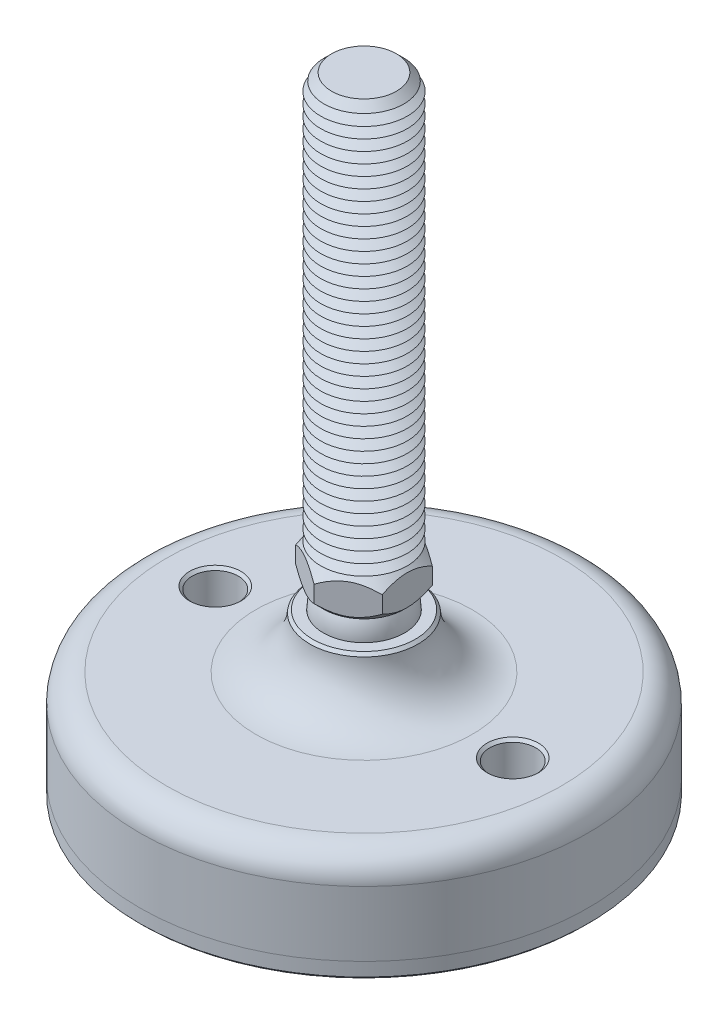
ISO-10303-21;
HEADER;
FILE_DESCRIPTION(('STEP AP214'),'2;1');
FILE_NAME('part.step','',(''),(''),'','','');
FILE_SCHEMA(('AUTOMOTIVE_DESIGN { 1 0 10303 214 1 1 1 1 }'));
ENDSEC;
DATA;
#1=APPLICATION_CONTEXT('core data for automotive mechanical design processes');
#2=APPLICATION_PROTOCOL_DEFINITION('international standard','automotive_design',2000,#1);
#3=PRODUCT_CONTEXT('',#1,'mechanical');
#4=PRODUCT('Part','Part','',(#3));
#5=PRODUCT_RELATED_PRODUCT_CATEGORY('part','',(#4));
#6=PRODUCT_DEFINITION_FORMATION('','',#4);
#7=PRODUCT_DEFINITION_CONTEXT('part definition',#1,'design');
#8=PRODUCT_DEFINITION('design','',#6,#7);
#9=PRODUCT_DEFINITION_SHAPE('','',#8);
#10=(LENGTH_UNIT() NAMED_UNIT(*) SI_UNIT(.MILLI.,.METRE.));
#11=(NAMED_UNIT(*) PLANE_ANGLE_UNIT() SI_UNIT($,.RADIAN.));
#12=(NAMED_UNIT(*) SI_UNIT($,.STERADIAN.) SOLID_ANGLE_UNIT());
#13=UNCERTAINTY_MEASURE_WITH_UNIT(LENGTH_MEASURE(1.E-05),#10,'distance_accuracy_value','');
#14=(GEOMETRIC_REPRESENTATION_CONTEXT(3) GLOBAL_UNCERTAINTY_ASSIGNED_CONTEXT((#13)) GLOBAL_UNIT_ASSIGNED_CONTEXT((#10,
#11,#12)) REPRESENTATION_CONTEXT('',''));
#15=CARTESIAN_POINT('',(0.,0.,0.));
#16=DIRECTION('',(0.,0.,1.));
#17=DIRECTION('',(1.,0.,0.));
#18=AXIS2_PLACEMENT_3D('',#15,#16,#17);
#19=CARTESIAN_POINT('',(0.,-27.,0.));
#20=DIRECTION('',(0.,1.,0.));
#21=DIRECTION('',(0.,0.,1.));
#22=AXIS2_PLACEMENT_3D('',#19,#20,#21);
#23=PLANE('',#22);
#24=CARTESIAN_POINT('',(-27.5,-27.,0.));
#25=DIRECTION('',(0.,1.,0.));
#26=DIRECTION('',(0.,0.,1.));
#27=AXIS2_PLACEMENT_3D('',#24,#25,#26);
#28=CIRCLE('',#27,4.25000000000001);
#29=CARTESIAN_POINT('',(-27.5,-27.,4.25000000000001));
#30=VERTEX_POINT('',#29);
#31=EDGE_CURVE('P0_E43',#30,#30,#28,.T.);
#32=ORIENTED_EDGE('',*,*,#31,.F.);
#33=EDGE_LOOP('',(#32));
#34=FACE_BOUND('',#33,.T.);
#35=CARTESIAN_POINT('',(27.5,-27.,0.));
#36=DIRECTION('',(0.,1.,0.));
#37=DIRECTION('',(0.,0.,1.));
#38=AXIS2_PLACEMENT_3D('',#35,#36,#37);
#39=CIRCLE('',#38,4.25000000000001);
#40=CARTESIAN_POINT('',(27.5,-27.,4.25000000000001));
#41=VERTEX_POINT('',#40);
#42=EDGE_CURVE('P0_E44',#41,#41,#39,.T.);
#43=ORIENTED_EDGE('',*,*,#42,.F.);
#44=EDGE_LOOP('',(#43));
#45=FACE_BOUND('',#44,.T.);
#46=CARTESIAN_POINT('',(0.,-27.,0.));
#47=DIRECTION('',(0.,1.,0.));
#48=DIRECTION('',(0.,0.,1.));
#49=AXIS2_PLACEMENT_3D('',#46,#47,#48);
#50=CIRCLE('',#49,41.5);
#51=CARTESIAN_POINT('',(0.,-27.,41.5));
#52=VERTEX_POINT('',#51);
#53=EDGE_CURVE('P0_E40',#52,#52,#50,.T.);
#54=ORIENTED_EDGE('',*,*,#53,.T.);
#55=EDGE_LOOP('',(#54));
#56=FACE_BOUND('',#55,.T.);
#57=ADVANCED_FACE('P0_F14',(#34,#45,#56),#23,.T.);
#58=CARTESIAN_POINT('',(0.,48.1654938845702,0.));
#59=DIRECTION('',(0.,1.,0.));
#60=DIRECTION('',(0.,0.,1.));
#61=AXIS2_PLACEMENT_3D('',#58,#59,#60);
#62=CYLINDRICAL_SURFACE('',#61,41.5);
#63=CARTESIAN_POINT('',(0.,-29.5,0.));
#64=DIRECTION('',(0.,-1.,0.));
#65=DIRECTION('',(0.,0.,-1.));
#66=AXIS2_PLACEMENT_3D('',#63,#64,#65);
#67=CIRCLE('',#66,41.5);
#68=CARTESIAN_POINT('',(0.,-29.5,-41.5));
#69=VERTEX_POINT('',#68);
#70=EDGE_CURVE('P0_E37',#69,#69,#67,.F.);
#71=ORIENTED_EDGE('',*,*,#70,.T.);
#72=EDGE_LOOP('',(#71));
#73=FACE_BOUND('',#72,.T.);
#74=ORIENTED_EDGE('',*,*,#53,.F.);
#75=EDGE_LOOP('',(#74));
#76=FACE_BOUND('',#75,.T.);
#77=ADVANCED_FACE('P0_F54',(#73,#76),#62,.T.);
#78=CARTESIAN_POINT('',(0.,-30.,41.5));
#79=DIRECTION('',(0.,-1.,0.));
#80=DIRECTION('',(0.,0.,-1.));
#81=AXIS2_PLACEMENT_3D('',#78,#79,#80);
#82=PLANE('',#81);
#83=CARTESIAN_POINT('',(27.5,-30.,0.));
#84=DIRECTION('',(0.,-1.,0.));
#85=DIRECTION('',(0.,0.,-1.));
#86=AXIS2_PLACEMENT_3D('',#83,#84,#85);
#87=CIRCLE('',#86,4.75);
#88=CARTESIAN_POINT('',(27.5,-30.,-4.75000000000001));
#89=VERTEX_POINT('',#88);
#90=EDGE_CURVE('P0_E25',#89,#89,#87,.F.);
#91=ORIENTED_EDGE('',*,*,#90,.T.);
#92=EDGE_LOOP('',(#91));
#93=FACE_BOUND('',#92,.T.);
#94=CARTESIAN_POINT('',(-27.5,-30.,0.));
#95=DIRECTION('',(0.,-1.,0.));
#96=DIRECTION('',(0.,0.,-1.));
#97=AXIS2_PLACEMENT_3D('',#94,#95,#96);
#98=CIRCLE('',#97,4.75);
#99=CARTESIAN_POINT('',(-27.5,-30.,-4.75));
#100=VERTEX_POINT('',#99);
#101=EDGE_CURVE('P0_E29',#100,#100,#98,.F.);
#102=ORIENTED_EDGE('',*,*,#101,.T.);
#103=EDGE_LOOP('',(#102));
#104=FACE_BOUND('',#103,.T.);
#105=CARTESIAN_POINT('',(0.,-30.,0.));
#106=DIRECTION('',(0.,-1.,0.));
#107=DIRECTION('',(0.,0.,-1.));
#108=AXIS2_PLACEMENT_3D('',#105,#106,#107);
#109=CIRCLE('',#108,41.);
#110=CARTESIAN_POINT('',(0.,-30.,-41.));
#111=VERTEX_POINT('',#110);
#112=EDGE_CURVE('P0_E34',#111,#111,#109,.T.);
#113=ORIENTED_EDGE('',*,*,#112,.T.);
#114=EDGE_LOOP('',(#113));
#115=FACE_BOUND('',#114,.T.);
#116=ADVANCED_FACE('P0_F61',(#93,#104,#115),#82,.T.);
#117=CARTESIAN_POINT('',(0.,-29.5,0.));
#118=DIRECTION('',(0.,1.,0.));
#119=DIRECTION('',(0.,0.,1.));
#120=AXIS2_PLACEMENT_3D('',#117,#118,#119);
#121=CONICAL_SURFACE('',#120,41.5,0.785398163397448);
#122=ORIENTED_EDGE('',*,*,#112,.F.);
#123=EDGE_LOOP('',(#122));
#124=FACE_BOUND('',#123,.T.);
#125=ORIENTED_EDGE('',*,*,#70,.F.);
#126=EDGE_LOOP('',(#125));
#127=FACE_BOUND('',#126,.T.);
#128=ADVANCED_FACE('P0_F68',(#124,#127),#121,.T.);
#129=CARTESIAN_POINT('',(27.5,-30.,0.));
#130=DIRECTION('',(0.,1.,0.));
#131=DIRECTION('',(0.,0.,1.));
#132=AXIS2_PLACEMENT_3D('',#129,#130,#131);
#133=CYLINDRICAL_SURFACE('',#132,4.25000000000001);
#134=CARTESIAN_POINT('',(27.5,-29.5,0.));
#135=DIRECTION('',(0.,-1.,0.));
#136=DIRECTION('',(0.,0.,-1.));
#137=AXIS2_PLACEMENT_3D('',#134,#135,#136);
#138=CIRCLE('',#137,4.25000000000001);
#139=CARTESIAN_POINT('',(27.5,-29.5,-4.25000000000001));
#140=VERTEX_POINT('',#139);
#141=EDGE_CURVE('P0_E21',#140,#140,#138,.T.);
#142=ORIENTED_EDGE('',*,*,#141,.T.);
#143=EDGE_LOOP('',(#142));
#144=FACE_BOUND('',#143,.T.);
#145=ORIENTED_EDGE('',*,*,#42,.T.);
#146=EDGE_LOOP('',(#145));
#147=FACE_BOUND('',#146,.T.);
#148=ADVANCED_FACE('P0_F74',(#144,#147),#133,.F.);
#149=CARTESIAN_POINT('',(-27.5,-30.,0.));
#150=DIRECTION('',(0.,1.,0.));
#151=DIRECTION('',(0.,0.,1.));
#152=AXIS2_PLACEMENT_3D('',#149,#150,#151);
#153=CYLINDRICAL_SURFACE('',#152,4.25000000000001);
#154=CARTESIAN_POINT('',(-27.5,-29.5,0.));
#155=DIRECTION('',(0.,-1.,0.));
#156=DIRECTION('',(0.,0.,-1.));
#157=AXIS2_PLACEMENT_3D('',#154,#155,#156);
#158=CIRCLE('',#157,4.25000000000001);
#159=CARTESIAN_POINT('',(-27.5,-29.5,-4.25000000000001));
#160=VERTEX_POINT('',#159);
#161=EDGE_CURVE('P0_E10',#160,#160,#158,.T.);
#162=ORIENTED_EDGE('',*,*,#161,.T.);
#163=EDGE_LOOP('',(#162));
#164=FACE_BOUND('',#163,.T.);
#165=ORIENTED_EDGE('',*,*,#31,.T.);
#166=EDGE_LOOP('',(#165));
#167=FACE_BOUND('',#166,.T.);
#168=ADVANCED_FACE('P0_F50',(#164,#167),#153,.F.);
#169=CARTESIAN_POINT('',(27.5,-30.,0.));
#170=DIRECTION('',(0.,-1.,0.));
#171=DIRECTION('',(0.,0.,-1.));
#172=AXIS2_PLACEMENT_3D('',#169,#170,#171);
#173=CONICAL_SURFACE('',#172,4.75,0.785398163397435);
#174=ORIENTED_EDGE('',*,*,#141,.F.);
#175=EDGE_LOOP('',(#174));
#176=FACE_BOUND('',#175,.T.);
#177=ORIENTED_EDGE('',*,*,#90,.F.);
#178=EDGE_LOOP('',(#177));
#179=FACE_BOUND('',#178,.T.);
#180=ADVANCED_FACE('P0_F76',(#176,#179),#173,.F.);
#181=CARTESIAN_POINT('',(-27.5,-30.,0.));
#182=DIRECTION('',(0.,-1.,0.));
#183=DIRECTION('',(0.,0.,-1.));
#184=AXIS2_PLACEMENT_3D('',#181,#182,#183);
#185=CONICAL_SURFACE('',#184,4.75,0.785398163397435);
#186=ORIENTED_EDGE('',*,*,#161,.F.);
#187=EDGE_LOOP('',(#186));
#188=FACE_BOUND('',#187,.T.);
#189=ORIENTED_EDGE('',*,*,#101,.F.);
#190=EDGE_LOOP('',(#189));
#191=FACE_BOUND('',#190,.T.);
#192=ADVANCED_FACE('P0_F16',(#188,#191),#185,.F.);
#193=CLOSED_SHELL('',(#57,#77,#116,#128,#148,#168,#180,#192));
#194=MANIFOLD_SOLID_BREP('P0_B1',#193);
#195=CARTESIAN_POINT('',(0.,3.75,0.));
#196=DIRECTION('',(0.,1.,0.));
#197=DIRECTION('',(0.,0.,1.));
#198=AXIS2_PLACEMENT_3D('',#195,#196,#197);
#199=PLANE('',#198);
#200=CARTESIAN_POINT('',(0.,3.75,0.));
#201=DIRECTION('',(0.,1.,0.));
#202=DIRECTION('',(0.,0.,1.));
#203=AXIS2_PLACEMENT_3D('',#200,#201,#202);
#204=CIRCLE('',#203,7.41889346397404);
#205=CARTESIAN_POINT('',(0.,3.75,7.41889346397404));
#206=VERTEX_POINT('',#205);
#207=EDGE_CURVE('P1_E213',#206,#206,#204,.T.);
#208=ORIENTED_EDGE('',*,*,#207,.F.);
#209=EDGE_LOOP('',(#208));
#210=FACE_BOUND('',#209,.T.);
#211=CARTESIAN_POINT('',(0.,3.75,0.));
#212=DIRECTION('',(0.,1.,0.));
#213=DIRECTION('',(0.,0.,1.));
#214=AXIS2_PLACEMENT_3D('',#211,#212,#213);
#215=CIRCLE('',#214,6.49519052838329);
#216=CARTESIAN_POINT('',(0.,3.75,6.49519052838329));
#217=VERTEX_POINT('',#216);
#218=EDGE_CURVE('P1_E25',#217,#217,#215,.F.);
#219=ORIENTED_EDGE('',*,*,#218,.F.);
#220=EDGE_LOOP('',(#219));
#221=FACE_BOUND('',#220,.T.);
#222=ADVANCED_FACE('P1_F16',(#210,#221),#199,.F.);
#223=CARTESIAN_POINT('',(0.,0.,0.));
#224=DIRECTION('',(0.,1.,0.));
#225=DIRECTION('',(0.,0.,-1.));
#226=AXIS2_PLACEMENT_3D('',#223,#224,#225);
#227=SPHERICAL_SURFACE('',#226,7.5);
#228=ORIENTED_EDGE('',*,*,#218,.T.);
#229=EDGE_LOOP('',(#228));
#230=FACE_BOUND('',#229,.T.);
#231=ADVANCED_FACE('P1_F203',(#230),#227,.T.);
#232=CARTESIAN_POINT('',(0.,3.75,0.));
#233=DIRECTION('',(0.,1.,0.));
#234=DIRECTION('',(0.,0.,1.));
#235=AXIS2_PLACEMENT_3D('',#232,#233,#234);
#236=CONICAL_SURFACE('',#235,7.41889346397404,0.785398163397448);
#237=ORIENTED_EDGE('',*,*,#207,.T.);
#238=EDGE_LOOP('',(#237));
#239=FACE_BOUND('',#238,.T.);
#240=CARTESIAN_POINT('',(-8.,8.67915108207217,-9.40607272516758));
#241=CARTESIAN_POINT('',(-8.,8.50538061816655,-9.17789983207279));
#242=CARTESIAN_POINT('',(-8.,8.33323236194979,-8.94847140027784));
#243=CARTESIAN_POINT('',(-8.,7.99291342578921,-8.48659991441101));
#244=CARTESIAN_POINT('',(-8.,7.82474372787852,-8.2541561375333));
#245=CARTESIAN_POINT('',(-8.,7.49191829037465,-7.78405005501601));
#246=CARTESIAN_POINT('',(-8.,7.32729980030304,-7.54636128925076));
#247=CARTESIAN_POINT('',(-8.,7.00401259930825,-7.066984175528));
#248=CARTESIAN_POINT('',(-8.,6.8453434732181,-6.82529610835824));
#249=CARTESIAN_POINT('',(-8.,6.52599353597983,-6.32262937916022));
#250=CARTESIAN_POINT('',(-8.,6.36576297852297,-6.06136321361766));
#251=CARTESIAN_POINT('',(-8.,6.05556462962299,-5.53271317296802));
#252=CARTESIAN_POINT('',(-8.,5.90559851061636,-5.26532831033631));
#253=CARTESIAN_POINT('',(-8.,5.61914583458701,-4.72442075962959));
#254=CARTESIAN_POINT('',(-8.,5.48261965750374,-4.45091921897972));
#255=CARTESIAN_POINT('',(-8.,5.22610459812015,-3.8963297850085));
#256=CARTESIAN_POINT('',(-8.,5.10610808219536,-3.61524546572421));
#257=CARTESIAN_POINT('',(-8.,4.89671738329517,-3.07036571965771));
#258=CARTESIAN_POINT('',(-8.,4.80554986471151,-2.80725883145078));
#259=CARTESIAN_POINT('',(-8.,4.64429812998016,-2.27454068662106));
#260=CARTESIAN_POINT('',(-8.,4.57421531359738,-2.00492899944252));
#261=CARTESIAN_POINT('',(-8.,4.46001937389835,-1.46539071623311));
#262=CARTESIAN_POINT('',(-8.,4.41544920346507,-1.19556248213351));
#263=CARTESIAN_POINT('',(-8.,4.35317465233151,-0.652806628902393));
#264=CARTESIAN_POINT('',(-8.,4.33546523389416,-0.379879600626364));
#265=CARTESIAN_POINT('',(-8.,4.3283167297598,0.155555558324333));
#266=CARTESIAN_POINT('',(-8.,4.33778869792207,0.418049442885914));
#267=CARTESIAN_POINT('',(-8.,4.38202991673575,0.940882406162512));
#268=CARTESIAN_POINT('',(-8.,4.41680155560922,1.2012212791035));
#269=CARTESIAN_POINT('',(-8.,4.51030475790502,1.72226548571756));
#270=CARTESIAN_POINT('',(-8.,4.56945097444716,1.9828951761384));
#271=CARTESIAN_POINT('',(-8.,4.7084911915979,2.498449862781));
#272=CARTESIAN_POINT('',(-8.,4.78838370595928,2.75337526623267));
#273=CARTESIAN_POINT('',(-8.,4.97226877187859,3.27629811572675));
#274=CARTESIAN_POINT('',(-8.,5.07763590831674,3.54380699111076));
#275=CARTESIAN_POINT('',(-8.,5.3045984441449,4.07191058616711));
#276=CARTESIAN_POINT('',(-8.,5.4262012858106,4.33250206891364));
#277=CARTESIAN_POINT('',(-8.,5.68274705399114,4.84802310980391));
#278=CARTESIAN_POINT('',(-8.,5.81773148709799,5.10293184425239));
#279=CARTESIAN_POINT('',(-8.,6.09806326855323,5.60689577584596));
#280=CARTESIAN_POINT('',(-8.,6.24340899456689,5.85595188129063));
#281=CARTESIAN_POINT('',(-8.,6.53502315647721,6.33676586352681));
#282=CARTESIAN_POINT('',(-8.,6.68088884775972,6.56876930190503));
#283=CARTESIAN_POINT('',(-8.,6.97879220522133,7.0287915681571));
#284=CARTESIAN_POINT('',(-8.,7.13083033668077,7.2568100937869));
#285=CARTESIAN_POINT('',(-8.,7.43872962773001,7.70754250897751));
#286=CARTESIAN_POINT('',(-8.,7.59454998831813,7.93028436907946));
#287=CARTESIAN_POINT('',(-8.,7.9103399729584,8.37271804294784));
#288=CARTESIAN_POINT('',(-8.,8.07030844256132,8.59241067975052));
#289=CARTESIAN_POINT('',(-8.,8.23197385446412,8.81082532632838));
#290=B_SPLINE_CURVE_WITH_KNOTS('',3,(#240,#241,#242,#243,#244,#245,#246,#247,#248,#249,#250,
#251,#252,#253,#254,#255,#256,#257,#258,#259,#260,#261,#262,#263,#264,#265,#266,#267,#268,#269,
#270,#271,#272,#273,#274,#275,#276,#277,#278,#279,#280,#281,#282,#283,#284,#285,#286,#287,#288,
#289),.UNSPECIFIED.,.F.,.F.,(4,2,2,2,2,2,2,2,2,2,2,2,2,2,2,2,2,2,2,2,2,2,2,2,4),(0.,
0.860441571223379,1.72109335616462,2.58840332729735,3.4556526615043,4.3749240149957,
5.2943447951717,6.21096847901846,7.12716742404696,7.96180281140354,8.7964935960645,
9.6157214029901,10.4347955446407,11.2215193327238,12.0083173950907,12.8090921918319,
13.6098096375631,14.471679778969,15.3339463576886,16.1989765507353,17.0638715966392,
17.8859014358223,18.7079933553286,19.5234450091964,20.3386721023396),.UNSPECIFIED.);
#291=CARTESIAN_POINT('',(-8.,5.56871084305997,-4.61880215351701));
#292=VERTEX_POINT('',#291);
#293=CARTESIAN_POINT('',(-8.,5.56871084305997,4.61880215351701));
#294=VERTEX_POINT('',#293);
#295=EDGE_CURVE('P1_E187',#292,#294,#290,.T.);
#296=ORIENTED_EDGE('',*,*,#295,.F.);
#297=CARTESIAN_POINT('',(0.000200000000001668,5.56882631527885,-9.23771977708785));
#298=CARTESIAN_POINT('',(-0.137352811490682,5.48941910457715,-9.15830362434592));
#299=CARTESIAN_POINT('',(-0.275962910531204,5.41244881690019,-9.07827704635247));
#300=CARTESIAN_POINT('',(-0.55550509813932,5.2641233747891,-8.91688328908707));
#301=CARTESIAN_POINT('',(-0.696438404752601,5.19277128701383,-8.83551540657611));
#302=CARTESIAN_POINT('',(-1.12434348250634,4.98764582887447,-8.58846429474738));
#303=CARTESIAN_POINT('',(-1.41493761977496,4.86367829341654,-8.42068969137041));
#304=CARTESIAN_POINT('',(-2.00094388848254,4.65139259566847,-8.08235881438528));
#305=CARTESIAN_POINT('',(-2.29620625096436,4.56253963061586,-7.91188900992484));
#306=CARTESIAN_POINT('',(-2.74395385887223,4.45975870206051,-7.65338180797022));
#307=CARTESIAN_POINT('',(-2.89386225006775,4.43059522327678,-7.5668321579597));
#308=CARTESIAN_POINT('',(-3.19494827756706,4.38309436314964,-7.39300005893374));
#309=CARTESIAN_POINT('',(-3.34612572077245,4.36475536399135,-7.30571772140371));
#310=CARTESIAN_POINT('',(-3.71452735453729,4.33400721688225,-7.09302093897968));
#311=CARTESIAN_POINT('',(-3.93214848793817,4.32755588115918,-6.96737731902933));
#312=CARTESIAN_POINT('',(-4.36699849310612,4.33838546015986,-6.71631655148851));
#313=CARTESIAN_POINT('',(-4.58422720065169,4.3556746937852,-6.59089949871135));
#314=CARTESIAN_POINT('',(-5.01663658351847,4.41296627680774,-6.3412478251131));
#315=CARTESIAN_POINT('',(-5.23181469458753,4.45299402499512,-6.21701468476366));
#316=CARTESIAN_POINT('',(-5.65847251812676,4.55358648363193,-5.97068367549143));
#317=CARTESIAN_POINT('',(-5.86995251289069,4.61414961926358,-5.84858564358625));
#318=CARTESIAN_POINT('',(-6.24536139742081,4.73874447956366,-5.63184322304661));
#319=CARTESIAN_POINT('',(-6.41012167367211,4.79949896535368,-5.53671883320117));
#320=CARTESIAN_POINT('',(-6.73668469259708,4.93079799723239,-5.34817758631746));
#321=CARTESIAN_POINT('',(-6.89848734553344,5.00134283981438,-5.25476078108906));
#322=CARTESIAN_POINT('',(-7.21862548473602,5.1506413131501,-5.06992894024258));
#323=CARTESIAN_POINT('',(-7.37697007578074,5.22936912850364,-4.97850864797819));
#324=CARTESIAN_POINT('',(-7.69072726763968,5.39400001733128,-4.79736084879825));
#325=CARTESIAN_POINT('',(-7.84614159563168,5.47989869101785,-4.70763234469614));
#326=CARTESIAN_POINT('',(-8.0002,5.56882631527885,-4.61868668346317));
#327=B_SPLINE_CURVE_WITH_KNOTS('',3,(#297,#298,#299,#300,#301,#302,#303,#304,#305,#306,#307,
#308,#309,#310,#311,#312,#313,#314,#315,#316,#317,#318,#319,#320,#321,#322,#323,#324,#325,#326),
.UNSPECIFIED.,.F.,.F.,(4,2,2,2,2,2,2,2,2,2,2,2,2,2,4),(0.,0.53269658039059,1.06568194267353,
2.13740664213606,3.19211397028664,3.71843331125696,4.24467396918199,4.99761238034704,
5.75081469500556,6.50485999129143,7.25884747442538,7.85770857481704,8.45658781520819,
9.05363199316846,9.65031250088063),.UNSPECIFIED.);
#328=CARTESIAN_POINT('',(0.,5.56871084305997,-9.23760430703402));
#329=VERTEX_POINT('',#328);
#330=EDGE_CURVE('P1_E181',#329,#292,#327,.T.);
#331=ORIENTED_EDGE('',*,*,#330,.F.);
#332=CARTESIAN_POINT('',(8.0002,5.56882631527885,-4.61868668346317));
#333=CARTESIAN_POINT('',(7.86264718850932,5.48941910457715,-4.69810283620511));
#334=CARTESIAN_POINT('',(7.72403708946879,5.4124488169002,-4.77812941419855));
#335=CARTESIAN_POINT('',(7.44449490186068,5.2641233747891,-4.93952317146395));
#336=CARTESIAN_POINT('',(7.3035615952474,5.19277128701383,-5.02089105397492));
#337=CARTESIAN_POINT('',(6.87565651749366,4.98764582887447,-5.26794216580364));
#338=CARTESIAN_POINT('',(6.58506238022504,4.86367829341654,-5.43571676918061));
#339=CARTESIAN_POINT('',(5.99905611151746,4.65139259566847,-5.77404764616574));
#340=CARTESIAN_POINT('',(5.70379374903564,4.56253963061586,-5.94451745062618));
#341=CARTESIAN_POINT('',(5.25604614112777,4.45975870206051,-6.2030246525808));
#342=CARTESIAN_POINT('',(5.10613774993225,4.43059522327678,-6.28957430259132));
#343=CARTESIAN_POINT('',(4.80505172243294,4.38309436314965,-6.46340640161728));
#344=CARTESIAN_POINT('',(4.65387427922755,4.36475536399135,-6.55068873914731));
#345=CARTESIAN_POINT('',(4.28547264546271,4.33400721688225,-6.76338552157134));
#346=CARTESIAN_POINT('',(4.06785151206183,4.32755588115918,-6.88902914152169));
#347=CARTESIAN_POINT('',(3.63300150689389,4.33838546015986,-7.14008990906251));
#348=CARTESIAN_POINT('',(3.41577279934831,4.3556746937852,-7.26550696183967));
#349=CARTESIAN_POINT('',(2.98336341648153,4.41296627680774,-7.51515863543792));
#350=CARTESIAN_POINT('',(2.76818530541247,4.45299402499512,-7.63939177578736));
#351=CARTESIAN_POINT('',(2.34152748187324,4.55358648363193,-7.88572278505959));
#352=CARTESIAN_POINT('',(2.13004748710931,4.61414961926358,-8.00782081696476));
#353=CARTESIAN_POINT('',(1.75463860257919,4.73874447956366,-8.22456323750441));
#354=CARTESIAN_POINT('',(1.58987832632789,4.79949896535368,-8.31968762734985));
#355=CARTESIAN_POINT('',(1.26331530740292,4.93079799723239,-8.50822887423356));
#356=CARTESIAN_POINT('',(1.10151265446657,5.00134283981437,-8.60164567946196));
#357=CARTESIAN_POINT('',(0.781374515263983,5.1506413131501,-8.78647752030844));
#358=CARTESIAN_POINT('',(0.623029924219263,5.22936912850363,-8.87789781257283));
#359=CARTESIAN_POINT('',(0.309272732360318,5.39400001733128,-9.05904561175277));
#360=CARTESIAN_POINT('',(0.153858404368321,5.47989869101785,-9.14877411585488));
#361=CARTESIAN_POINT('',(-0.000199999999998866,5.56882631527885,-9.23771977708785));
#362=B_SPLINE_CURVE_WITH_KNOTS('',3,(#332,#333,#334,#335,#336,#337,#338,#339,#340,#341,#342,
#343,#344,#345,#346,#347,#348,#349,#350,#351,#352,#353,#354,#355,#356,#357,#358,#359,#360,#361),
.UNSPECIFIED.,.F.,.F.,(4,2,2,2,2,2,2,2,2,2,2,2,2,2,4),(0.,0.532696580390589,1.06568194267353,
2.13740664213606,3.19211397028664,3.71843331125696,4.24467396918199,4.99761238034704,
5.75081469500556,6.50485999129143,7.25884747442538,7.85770857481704,8.45658781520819,
9.05363199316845,9.65031250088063),.UNSPECIFIED.);
#363=CARTESIAN_POINT('',(8.,5.56871084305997,-4.61880215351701));
#364=VERTEX_POINT('',#363);
#365=EDGE_CURVE('P1_E169',#364,#329,#362,.T.);
#366=ORIENTED_EDGE('',*,*,#365,.F.);
#367=CARTESIAN_POINT('',(8.,8.67915108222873,-9.40607272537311));
#368=CARTESIAN_POINT('',(8.,8.50538061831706,-9.17789983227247));
#369=CARTESIAN_POINT('',(8.,8.33323236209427,-8.94847140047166));
#370=CARTESIAN_POINT('',(8.,7.99291342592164,-8.48659991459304));
#371=CARTESIAN_POINT('',(8.,7.82474372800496,-8.25415613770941));
#372=CARTESIAN_POINT('',(8.,7.49191829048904,-7.78405005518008));
#373=CARTESIAN_POINT('',(8.,7.32729980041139,-7.54636128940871));
#374=CARTESIAN_POINT('',(8.,7.00401259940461,-7.0669841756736));
#375=CARTESIAN_POINT('',(8.,6.84534347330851,-6.82529610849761));
#376=CARTESIAN_POINT('',(8.,6.52599353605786,-6.32262937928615));
#377=CARTESIAN_POINT('',(8.,6.36576297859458,-6.06136321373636));
#378=CARTESIAN_POINT('',(8.,6.05556462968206,-5.53271317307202));
#379=CARTESIAN_POINT('',(8.,5.90559851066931,-5.26532831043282));
#380=CARTESIAN_POINT('',(8.,5.61914583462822,-4.72442075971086));
#381=CARTESIAN_POINT('',(8.,5.48261965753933,-4.45091921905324));
#382=CARTESIAN_POINT('',(8.,5.22610459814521,-3.8963297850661));
#383=CARTESIAN_POINT('',(8.,5.10610808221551,-3.61524546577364));
#384=CARTESIAN_POINT('',(8.,4.89671738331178,-3.07036571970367));
#385=CARTESIAN_POINT('',(8.,4.80554986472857,-2.8072588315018));
#386=CARTESIAN_POINT('',(8.,4.6442981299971,-2.27454068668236));
#387=CARTESIAN_POINT('',(8.,4.57421531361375,-2.00492899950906));
#388=CARTESIAN_POINT('',(8.,4.46001937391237,-1.46539071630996));
#389=CARTESIAN_POINT('',(8.,4.41544920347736,-1.19556248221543));
#390=CARTESIAN_POINT('',(8.,4.35317465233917,-0.65280662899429));
#391=CARTESIAN_POINT('',(8.,4.33546523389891,-0.379879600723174));
#392=CARTESIAN_POINT('',(8.,4.32831672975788,0.155555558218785));
#393=CARTESIAN_POINT('',(8.,4.33778869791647,0.41804944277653));
#394=CARTESIAN_POINT('',(8.,4.38202991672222,0.940882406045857));
#395=CARTESIAN_POINT('',(8.,4.41680155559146,1.20122127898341));
#396=CARTESIAN_POINT('',(8.,4.51030475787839,1.72226548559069));
#397=CARTESIAN_POINT('',(8.,4.56945097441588,1.9828951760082));
#398=CARTESIAN_POINT('',(8.,4.70849119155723,2.49844986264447));
#399=CARTESIAN_POINT('',(8.,4.78838370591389,2.75337526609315));
#400=CARTESIAN_POINT('',(8.,4.97226877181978,3.27629811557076));
#401=CARTESIAN_POINT('',(8.,5.07763590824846,3.5438069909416));
#402=CARTESIAN_POINT('',(8.,5.30459844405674,4.07191058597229));
#403=CARTESIAN_POINT('',(8.,5.42620128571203,4.33250206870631));
#404=CARTESIAN_POINT('',(8.,5.68274705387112,4.84802310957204));
#405=CARTESIAN_POINT('',(8.,5.81773148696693,5.10293184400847));
#406=CARTESIAN_POINT('',(8.,6.09806326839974,5.60689577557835));
#407=CARTESIAN_POINT('',(8.,6.24340899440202,5.85595188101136));
#408=CARTESIAN_POINT('',(8.,6.53502315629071,6.33676586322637));
#409=CARTESIAN_POINT('',(8.,6.68088884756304,6.56876930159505));
#410=CARTESIAN_POINT('',(8.,6.97879220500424,7.02879156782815));
#411=CARTESIAN_POINT('',(8.,7.13083033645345,7.25681009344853));
#412=CARTESIAN_POINT('',(8.,7.43872962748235,7.70754250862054));
#413=CARTESIAN_POINT('',(8.,7.59454998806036,7.93028436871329));
#414=CARTESIAN_POINT('',(8.,7.91033997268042,8.37271804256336));
#415=CARTESIAN_POINT('',(8.,8.07030844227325,8.59241067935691));
#416=CARTESIAN_POINT('',(8.,8.23197385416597,8.81082532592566));
#417=B_SPLINE_CURVE_WITH_KNOTS('',3,(#367,#368,#369,#370,#371,#372,#373,#374,#375,#376,#377,
#378,#379,#380,#381,#382,#383,#384,#385,#386,#387,#388,#389,#390,#391,#392,#393,#394,#395,#396,
#397,#398,#399,#400,#401,#402,#403,#404,#405,#406,#407,#408,#409,#410,#411,#412,#413,#414,#415,
#416),.UNSPECIFIED.,.F.,.F.,(4,2,2,2,2,2,2,2,2,2,2,2,2,2,2,2,2,2,2,2,2,2,2,2,4),(0.,
0.860441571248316,1.7210933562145,2.58840332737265,3.45565266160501,4.37492401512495,
5.2943447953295,6.21096847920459,7.12716742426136,7.96180281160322,8.79649359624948,
9.61572140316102,10.4347955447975,11.2215193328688,12.0083173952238,12.8090921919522,
13.6098096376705,14.4716797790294,15.3339463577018,16.1989765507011,17.0638715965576,
17.8859014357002,18.7079933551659,19.5234450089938,20.338672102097),.UNSPECIFIED.);
#418=CARTESIAN_POINT('',(8.,5.56871084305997,4.61880215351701));
#419=VERTEX_POINT('',#418);
#420=EDGE_CURVE('P1_E71',#419,#364,#417,.F.);
#421=ORIENTED_EDGE('',*,*,#420,.F.);
#422=CARTESIAN_POINT('',(-0.000199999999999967,5.56882631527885,9.23771977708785));
#423=CARTESIAN_POINT('',(0.137352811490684,5.48941910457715,9.15830362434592));
#424=CARTESIAN_POINT('',(0.275962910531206,5.41244881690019,9.07827704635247));
#425=CARTESIAN_POINT('',(0.555505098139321,5.2641233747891,8.91688328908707));
#426=CARTESIAN_POINT('',(0.696438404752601,5.19277128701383,8.83551540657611));
#427=CARTESIAN_POINT('',(1.12434348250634,4.98764582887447,8.58846429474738));
#428=CARTESIAN_POINT('',(1.41493761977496,4.86367829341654,8.42068969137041));
#429=CARTESIAN_POINT('',(2.00094388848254,4.65139259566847,8.08235881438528));
#430=CARTESIAN_POINT('',(2.29620625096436,4.56253963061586,7.91188900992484));
#431=CARTESIAN_POINT('',(2.74395385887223,4.45975870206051,7.65338180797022));
#432=CARTESIAN_POINT('',(2.89386225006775,4.43059522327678,7.5668321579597));
#433=CARTESIAN_POINT('',(3.19494827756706,4.38309436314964,7.39300005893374));
#434=CARTESIAN_POINT('',(3.34612572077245,4.36475536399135,7.30571772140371));
#435=CARTESIAN_POINT('',(3.71452735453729,4.33400721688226,7.09302093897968));
#436=CARTESIAN_POINT('',(3.93214848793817,4.32755588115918,6.96737731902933));
#437=CARTESIAN_POINT('',(4.36699849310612,4.33838546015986,6.71631655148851));
#438=CARTESIAN_POINT('',(4.58422720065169,4.3556746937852,6.59089949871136));
#439=CARTESIAN_POINT('',(5.01663658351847,4.41296627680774,6.3412478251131));
#440=CARTESIAN_POINT('',(5.23181469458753,4.45299402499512,6.21701468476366));
#441=CARTESIAN_POINT('',(5.65847251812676,4.55358648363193,5.97068367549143));
#442=CARTESIAN_POINT('',(5.86995251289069,4.61414961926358,5.84858564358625));
#443=CARTESIAN_POINT('',(6.24536139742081,4.73874447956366,5.63184322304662));
#444=CARTESIAN_POINT('',(6.41012167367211,4.79949896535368,5.53671883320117));
#445=CARTESIAN_POINT('',(6.73668469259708,4.93079799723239,5.34817758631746));
#446=CARTESIAN_POINT('',(6.89848734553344,5.00134283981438,5.25476078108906));
#447=CARTESIAN_POINT('',(7.21862548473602,5.1506413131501,5.06992894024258));
#448=CARTESIAN_POINT('',(7.37697007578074,5.22936912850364,4.97850864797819));
#449=CARTESIAN_POINT('',(7.69072726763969,5.39400001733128,4.79736084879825));
#450=CARTESIAN_POINT('',(7.84614159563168,5.47989869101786,4.70763234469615));
#451=CARTESIAN_POINT('',(8.0002,5.56882631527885,4.61868668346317));
#452=B_SPLINE_CURVE_WITH_KNOTS('',3,(#422,#423,#424,#425,#426,#427,#428,#429,#430,#431,#432,
#433,#434,#435,#436,#437,#438,#439,#440,#441,#442,#443,#444,#445,#446,#447,#448,#449,#450,#451),
.UNSPECIFIED.,.F.,.F.,(4,2,2,2,2,2,2,2,2,2,2,2,2,2,4),(0.,0.532696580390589,1.06568194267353,
2.13740664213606,3.19211397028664,3.71843331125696,4.24467396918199,4.99761238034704,
5.75081469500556,6.50485999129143,7.25884747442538,7.85770857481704,8.45658781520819,
9.05363199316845,9.65031250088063),.UNSPECIFIED.);
#453=CARTESIAN_POINT('',(0.,5.56871084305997,9.23760430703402));
#454=VERTEX_POINT('',#453);
#455=EDGE_CURVE('P1_E68',#454,#419,#452,.T.);
#456=ORIENTED_EDGE('',*,*,#455,.F.);
#457=CARTESIAN_POINT('',(-8.0002,5.56882631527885,4.61868668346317));
#458=CARTESIAN_POINT('',(-7.86264718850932,5.48941910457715,4.6981028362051));
#459=CARTESIAN_POINT('',(-7.7240370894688,5.41244881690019,4.77812941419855));
#460=CARTESIAN_POINT('',(-7.44449490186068,5.2641233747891,4.93952317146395));
#461=CARTESIAN_POINT('',(-7.3035615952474,5.19277128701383,5.02089105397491));
#462=CARTESIAN_POINT('',(-6.87565651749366,4.98764582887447,5.26794216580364));
#463=CARTESIAN_POINT('',(-6.58506238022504,4.86367829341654,5.43571676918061));
#464=CARTESIAN_POINT('',(-5.99905611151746,4.65139259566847,5.77404764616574));
#465=CARTESIAN_POINT('',(-5.70379374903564,4.56253963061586,5.94451745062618));
#466=CARTESIAN_POINT('',(-5.25604614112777,4.45975870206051,6.2030246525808));
#467=CARTESIAN_POINT('',(-5.10613774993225,4.43059522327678,6.28957430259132));
#468=CARTESIAN_POINT('',(-4.80505172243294,4.38309436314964,6.46340640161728));
#469=CARTESIAN_POINT('',(-4.65387427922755,4.36475536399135,6.55068873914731));
#470=CARTESIAN_POINT('',(-4.28547264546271,4.33400721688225,6.76338552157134));
#471=CARTESIAN_POINT('',(-4.06785151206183,4.32755588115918,6.88902914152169));
#472=CARTESIAN_POINT('',(-3.63300150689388,4.33838546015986,7.14008990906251));
#473=CARTESIAN_POINT('',(-3.4157727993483,4.3556746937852,7.26550696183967));
#474=CARTESIAN_POINT('',(-2.98336341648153,4.41296627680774,7.51515863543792));
#475=CARTESIAN_POINT('',(-2.76818530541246,4.45299402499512,7.63939177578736));
#476=CARTESIAN_POINT('',(-2.34152748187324,4.55358648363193,7.88572278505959));
#477=CARTESIAN_POINT('',(-2.13004748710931,4.61414961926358,8.00782081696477));
#478=CARTESIAN_POINT('',(-1.75463860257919,4.73874447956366,8.22456323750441));
#479=CARTESIAN_POINT('',(-1.58987832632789,4.79949896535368,8.31968762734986));
#480=CARTESIAN_POINT('',(-1.26331530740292,4.93079799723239,8.50822887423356));
#481=CARTESIAN_POINT('',(-1.10151265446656,5.00134283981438,8.60164567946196));
#482=CARTESIAN_POINT('',(-0.781374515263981,5.1506413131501,8.78647752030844));
#483=CARTESIAN_POINT('',(-0.623029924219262,5.22936912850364,8.87789781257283));
#484=CARTESIAN_POINT('',(-0.309272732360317,5.39400001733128,9.05904561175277));
#485=CARTESIAN_POINT('',(-0.15385840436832,5.47989869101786,9.14877411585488));
#486=CARTESIAN_POINT('',(0.000199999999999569,5.56882631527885,9.23771977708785));
#487=B_SPLINE_CURVE_WITH_KNOTS('',3,(#457,#458,#459,#460,#461,#462,#463,#464,#465,#466,#467,
#468,#469,#470,#471,#472,#473,#474,#475,#476,#477,#478,#479,#480,#481,#482,#483,#484,#485,#486),
.UNSPECIFIED.,.F.,.F.,(4,2,2,2,2,2,2,2,2,2,2,2,2,2,4),(0.,0.532696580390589,1.06568194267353,
2.13740664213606,3.19211397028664,3.71843331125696,4.244673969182,4.99761238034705,
5.75081469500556,6.50485999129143,7.25884747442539,7.85770857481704,8.4565878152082,
9.05363199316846,9.65031250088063),.UNSPECIFIED.);
#488=EDGE_CURVE('P1_E40',#294,#454,#487,.T.);
#489=ORIENTED_EDGE('',*,*,#488,.F.);
#490=EDGE_LOOP('',(#296,#331,#366,#421,#456,#489));
#491=FACE_BOUND('',#490,.T.);
#492=ADVANCED_FACE('P1_F69',(#239,#491),#236,.T.);
#493=CARTESIAN_POINT('',(-8.,11.,-4.61880215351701));
#494=DIRECTION('',(1.,0.,0.));
#495=DIRECTION('',(0.,0.,-1.));
#496=AXIS2_PLACEMENT_3D('',#493,#494,#495);
#497=PLANE('',#496);
#498=DIRECTION('',(0.,-1.,0.));
#499=VECTOR('',#498,1.);
#500=CARTESIAN_POINT('',(-8.,11.,4.61880215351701));
#501=LINE('',#500,#499);
#502=CARTESIAN_POINT('',(-8.,8.6905989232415,4.61880215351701));
#503=VERTEX_POINT('',#502);
#504=EDGE_CURVE('P1_E84',#503,#294,#501,.T.);
#505=ORIENTED_EDGE('',*,*,#504,.F.);
#506=CARTESIAN_POINT('',(-8.,5.72751350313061,-9.21177669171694));
#507=CARTESIAN_POINT('',(-8.,5.89682366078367,-8.98748005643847));
#508=CARTESIAN_POINT('',(-8.,6.06449721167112,-8.76192759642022));
#509=CARTESIAN_POINT('',(-8.,6.39583833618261,-8.30781564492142));
#510=CARTESIAN_POINT('',(-8.,6.55950489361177,-8.07925541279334));
#511=CARTESIAN_POINT('',(-8.,6.88326292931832,-7.6169606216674));
#512=CARTESIAN_POINT('',(-8.,7.04331688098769,-7.38319969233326));
#513=CARTESIAN_POINT('',(-8.,7.35745062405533,-6.91170999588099));
#514=CARTESIAN_POINT('',(-8.,7.51153083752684,-6.67398151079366));
#515=CARTESIAN_POINT('',(-8.,7.82098685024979,-6.18020562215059));
#516=CARTESIAN_POINT('',(-8.,7.97593334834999,-5.92388779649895));
#517=CARTESIAN_POINT('',(-8.,8.2756319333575,-5.40526917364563));
#518=CARTESIAN_POINT('',(-8.,8.42038240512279,-5.14296743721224));
#519=CARTESIAN_POINT('',(-8.,8.69656572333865,-4.61240539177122));
#520=CARTESIAN_POINT('',(-8.,8.82803773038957,-4.3441656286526));
#521=CARTESIAN_POINT('',(-8.,9.07472095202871,-3.80037048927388));
#522=CARTESIAN_POINT('',(-8.,9.18993952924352,-3.52481849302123));
#523=CARTESIAN_POINT('',(-8.,9.39155974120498,-2.98846490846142));
#524=CARTESIAN_POINT('',(-8.,9.47953421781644,-2.72826076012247));
#525=CARTESIAN_POINT('',(-8.,9.63460815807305,-2.20158778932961));
#526=CARTESIAN_POINT('',(-8.,9.70170618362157,-1.93511853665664));
#527=CARTESIAN_POINT('',(-8.,9.81040693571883,-1.40193852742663));
#528=CARTESIAN_POINT('',(-8.,9.85244648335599,-1.13531830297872));
#529=CARTESIAN_POINT('',(-8.,9.91021431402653,-0.599227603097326));
#530=CARTESIAN_POINT('',(-8.,9.92594711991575,-0.329757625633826));
#531=CARTESIAN_POINT('',(-8.,9.92993303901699,0.1996220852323));
#532=CARTESIAN_POINT('',(-8.,9.91916018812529,0.459524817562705));
#533=CARTESIAN_POINT('',(-8.,9.87287879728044,0.977104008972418));
#534=CARTESIAN_POINT('',(-8.,9.83736785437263,1.23478024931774));
#535=CARTESIAN_POINT('',(-8.,9.74294362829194,1.75039800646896));
#536=CARTESIAN_POINT('',(-8.,9.68363209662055,2.00826541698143));
#537=CARTESIAN_POINT('',(-8.,9.544769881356,2.51838158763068));
#538=CARTESIAN_POINT('',(-8.,9.46522089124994,2.77063081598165));
#539=CARTESIAN_POINT('',(-8.,9.28097494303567,3.29235438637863));
#540=CARTESIAN_POINT('',(-8.,9.17462363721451,3.56123855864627));
#541=CARTESIAN_POINT('',(-8.,8.94559365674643,4.09202258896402));
#542=CARTESIAN_POINT('',(-8.,8.82290737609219,4.35391912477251));
#543=CARTESIAN_POINT('',(-8.,8.56412641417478,4.87200778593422));
#544=CARTESIAN_POINT('',(-8.,8.42798963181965,5.12817871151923));
#545=CARTESIAN_POINT('',(-8.,8.14531665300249,5.63462540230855));
#546=CARTESIAN_POINT('',(-8.,7.99878211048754,5.88490209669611));
#547=CARTESIAN_POINT('',(-8.,7.70486004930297,6.36801618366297));
#548=CARTESIAN_POINT('',(-8.,7.55787799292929,6.60110156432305));
#549=CARTESIAN_POINT('',(-8.,7.25773303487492,7.06327081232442));
#550=CARTESIAN_POINT('',(-8.,7.10456966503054,7.29235437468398));
#551=CARTESIAN_POINT('',(-8.,6.79443207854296,7.74518607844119));
#552=CARTESIAN_POINT('',(-8.,6.63749892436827,7.96896244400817));
#553=CARTESIAN_POINT('',(-8.,6.31948249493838,8.413457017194));
#554=CARTESIAN_POINT('',(-8.,6.15840037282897,8.63417604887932));
#555=CARTESIAN_POINT('',(-8.,5.99562197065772,8.85361482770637));
#556=B_SPLINE_CURVE_WITH_KNOTS('',3,(#506,#507,#508,#509,#510,#511,#512,#513,#514,#515,#516,
#517,#518,#519,#520,#521,#522,#523,#524,#525,#526,#527,#528,#529,#530,#531,#532,#533,#534,#535,
#536,#537,#538,#539,#540,#541,#542,#543,#544,#545,#546,#547,#548,#549,#550,#551,#552,#553,#554,
#555),.UNSPECIFIED.,.F.,.F.,(4,2,2,2,2,2,2,2,2,2,2,2,2,2,2,2,2,2,2,2,2,2,2,2,4),(0.,
0.843090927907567,1.68639349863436,2.53623021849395,3.38600678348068,4.28435323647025,
5.18284167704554,6.07859779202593,6.97394682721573,7.79724439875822,8.62059867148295,
9.42914521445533,10.2375527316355,11.0166993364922,11.7959216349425,12.5887656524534,
13.381543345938,14.248326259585,15.1155141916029,15.9855080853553,16.8553639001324,
17.6819249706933,18.5085487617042,19.328457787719,20.1481413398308),.UNSPECIFIED.);
#557=CARTESIAN_POINT('',(-8.,8.6905989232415,-4.61880215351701));
#558=VERTEX_POINT('',#557);
#559=EDGE_CURVE('P1_E85',#503,#558,#556,.F.);
#560=ORIENTED_EDGE('',*,*,#559,.T.);
#561=DIRECTION('',(0.,-1.,0.));
#562=VECTOR('',#561,1.);
#563=CARTESIAN_POINT('',(-8.,11.,-4.61880215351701));
#564=LINE('',#563,#562);
#565=EDGE_CURVE('P1_E102',#558,#292,#564,.T.);
#566=ORIENTED_EDGE('',*,*,#565,.T.);
#567=ORIENTED_EDGE('',*,*,#295,.T.);
#568=EDGE_LOOP('',(#505,#560,#566,#567));
#569=FACE_BOUND('',#568,.T.);
#570=ADVANCED_FACE('P1_F195',(#569),#497,.F.);
#571=CARTESIAN_POINT('',(0.,11.,-9.23760430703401));
#572=DIRECTION('',(0.5,0.,0.866025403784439));
#573=DIRECTION('',(0.866025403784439,0.,-0.5));
#574=AXIS2_PLACEMENT_3D('',#571,#572,#573);
#575=PLANE('',#574);
#576=ORIENTED_EDGE('',*,*,#565,.F.);
#577=CARTESIAN_POINT('',(-8.0002,8.69048345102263,-4.61868668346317));
#578=CARTESIAN_POINT('',(-7.86264718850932,8.76989066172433,-4.69810283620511));
#579=CARTESIAN_POINT('',(-7.72403708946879,8.84686094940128,-4.77812941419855));
#580=CARTESIAN_POINT('',(-7.44449490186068,8.99518639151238,-4.93952317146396));
#581=CARTESIAN_POINT('',(-7.3035615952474,9.06653847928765,-5.02089105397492));
#582=CARTESIAN_POINT('',(-6.87565651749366,9.271663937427,-5.26794216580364));
#583=CARTESIAN_POINT('',(-6.58506238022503,9.39563147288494,-5.43571676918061));
#584=CARTESIAN_POINT('',(-5.99905611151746,9.60791717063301,-5.77404764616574));
#585=CARTESIAN_POINT('',(-5.70379374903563,9.69677013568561,-5.94451745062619));
#586=CARTESIAN_POINT('',(-5.25604614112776,9.79955106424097,-6.20302465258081));
#587=CARTESIAN_POINT('',(-5.10613774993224,9.8287145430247,-6.28957430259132));
#588=CARTESIAN_POINT('',(-4.80505172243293,9.87621540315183,-6.46340640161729));
#589=CARTESIAN_POINT('',(-4.65387427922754,9.89455440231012,-6.55068873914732));
#590=CARTESIAN_POINT('',(-4.2854726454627,9.92530254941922,-6.76338552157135));
#591=CARTESIAN_POINT('',(-4.06785151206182,9.93175388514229,-6.8890291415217));
#592=CARTESIAN_POINT('',(-3.63300150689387,9.92092430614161,-7.14008990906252));
#593=CARTESIAN_POINT('',(-3.41577279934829,9.90363507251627,-7.26550696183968));
#594=CARTESIAN_POINT('',(-2.98336341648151,9.84634348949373,-7.51515863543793));
#595=CARTESIAN_POINT('',(-2.76818530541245,9.80631574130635,-7.63939177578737));
#596=CARTESIAN_POINT('',(-2.34152748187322,9.70572328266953,-7.88572278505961));
#597=CARTESIAN_POINT('',(-2.13004748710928,9.64516014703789,-8.00782081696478));
#598=CARTESIAN_POINT('',(-1.75463860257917,9.5205652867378,-8.22456323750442));
#599=CARTESIAN_POINT('',(-1.58987832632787,9.45981080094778,-8.31968762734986));
#600=CARTESIAN_POINT('',(-1.2633153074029,9.32851176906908,-8.50822887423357));
#601=CARTESIAN_POINT('',(-1.10151265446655,9.25796692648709,-8.60164567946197));
#602=CARTESIAN_POINT('',(-0.781374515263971,9.10866845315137,-8.78647752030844));
#603=CARTESIAN_POINT('',(-0.623029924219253,9.02994063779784,-8.87789781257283));
#604=CARTESIAN_POINT('',(-0.309272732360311,8.86530974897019,-9.05904561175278));
#605=CARTESIAN_POINT('',(-0.153858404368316,8.77941107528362,-9.14877411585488));
#606=CARTESIAN_POINT('',(0.000200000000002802,8.69048345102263,-9.23771977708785));
#607=B_SPLINE_CURVE_WITH_KNOTS('',3,(#577,#578,#579,#580,#581,#582,#583,#584,#585,#586,#587,
#588,#589,#590,#591,#592,#593,#594,#595,#596,#597,#598,#599,#600,#601,#602,#603,#604,#605,#606),
.UNSPECIFIED.,.F.,.F.,(4,2,2,2,2,2,2,2,2,2,2,2,2,2,4),(0.,0.532696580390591,1.06568194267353,
2.13740664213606,3.19211397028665,3.71843331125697,4.24467396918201,4.99761238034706,
5.75081469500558,6.50485999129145,7.25884747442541,7.85770857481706,8.4565878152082,
9.05363199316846,9.65031250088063),.UNSPECIFIED.);
#608=CARTESIAN_POINT('',(0.,8.6905989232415,-9.23760430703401));
#609=VERTEX_POINT('',#608);
#610=EDGE_CURVE('P1_E32',#558,#609,#607,.T.);
#611=ORIENTED_EDGE('',*,*,#610,.T.);
#612=DIRECTION('',(0.,-1.,0.));
#613=VECTOR('',#612,1.);
#614=CARTESIAN_POINT('',(0.,11.,-9.23760430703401));
#615=LINE('',#614,#613);
#616=EDGE_CURVE('P1_E99',#609,#329,#615,.T.);
#617=ORIENTED_EDGE('',*,*,#616,.T.);
#618=ORIENTED_EDGE('',*,*,#330,.T.);
#619=EDGE_LOOP('',(#576,#611,#617,#618));
#620=FACE_BOUND('',#619,.T.);
#621=ADVANCED_FACE('P1_F192',(#620),#575,.F.);
#622=CARTESIAN_POINT('',(8.,11.,-4.61880215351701));
#623=DIRECTION('',(-0.5,0.,0.866025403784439));
#624=DIRECTION('',(0.866025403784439,0.,0.5));
#625=AXIS2_PLACEMENT_3D('',#622,#623,#624);
#626=PLANE('',#625);
#627=ORIENTED_EDGE('',*,*,#616,.F.);
#628=CARTESIAN_POINT('',(-0.000199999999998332,8.69048345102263,-9.23771977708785));
#629=CARTESIAN_POINT('',(0.137352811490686,8.76989066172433,-9.15830362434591));
#630=CARTESIAN_POINT('',(0.275962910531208,8.84686094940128,-9.07827704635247));
#631=CARTESIAN_POINT('',(0.555505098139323,8.99518639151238,-8.91688328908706));
#632=CARTESIAN_POINT('',(0.696438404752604,9.06653847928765,-8.8355154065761));
#633=CARTESIAN_POINT('',(1.12434348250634,9.27166393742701,-8.58846429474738));
#634=CARTESIAN_POINT('',(1.41493761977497,9.39563147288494,-8.42068969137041));
#635=CARTESIAN_POINT('',(2.00094388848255,9.60791717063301,-8.08235881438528));
#636=CARTESIAN_POINT('',(2.29620625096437,9.69677013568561,-7.91188900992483));
#637=CARTESIAN_POINT('',(2.74395385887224,9.79955106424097,-7.65338180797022));
#638=CARTESIAN_POINT('',(2.89386225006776,9.8287145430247,-7.5668321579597));
#639=CARTESIAN_POINT('',(3.19494827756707,9.87621540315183,-7.39300005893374));
#640=CARTESIAN_POINT('',(3.34612572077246,9.89455440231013,-7.3057177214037));
#641=CARTESIAN_POINT('',(3.7145273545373,9.92530254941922,-7.09302093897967));
#642=CARTESIAN_POINT('',(3.93214848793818,9.9317538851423,-6.96737731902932));
#643=CARTESIAN_POINT('',(4.36699849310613,9.92092430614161,-6.7163165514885));
#644=CARTESIAN_POINT('',(4.58422720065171,9.90363507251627,-6.59089949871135));
#645=CARTESIAN_POINT('',(5.01663658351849,9.84634348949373,-6.34124782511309));
#646=CARTESIAN_POINT('',(5.23181469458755,9.80631574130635,-6.21701468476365));
#647=CARTESIAN_POINT('',(5.65847251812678,9.70572328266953,-5.97068367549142));
#648=CARTESIAN_POINT('',(5.86995251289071,9.64516014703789,-5.84858564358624));
#649=CARTESIAN_POINT('',(6.24536139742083,9.5205652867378,-5.6318432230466));
#650=CARTESIAN_POINT('',(6.41012167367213,9.45981080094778,-5.53671883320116));
#651=CARTESIAN_POINT('',(6.7366846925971,9.32851176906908,-5.34817758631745));
#652=CARTESIAN_POINT('',(6.89848734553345,9.25796692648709,-5.25476078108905));
#653=CARTESIAN_POINT('',(7.21862548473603,9.10866845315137,-5.06992894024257));
#654=CARTESIAN_POINT('',(7.37697007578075,9.02994063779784,-4.97850864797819));
#655=CARTESIAN_POINT('',(7.69072726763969,8.86530974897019,-4.79736084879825));
#656=CARTESIAN_POINT('',(7.84614159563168,8.77941107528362,-4.70763234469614));
#657=CARTESIAN_POINT('',(8.0002,8.69048345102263,-4.61868668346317));
#658=B_SPLINE_CURVE_WITH_KNOTS('',3,(#628,#629,#630,#631,#632,#633,#634,#635,#636,#637,#638,
#639,#640,#641,#642,#643,#644,#645,#646,#647,#648,#649,#650,#651,#652,#653,#654,#655,#656,#657),
.UNSPECIFIED.,.F.,.F.,(4,2,2,2,2,2,2,2,2,2,2,2,2,2,4),(0.,0.53269658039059,1.06568194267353,
2.13740664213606,3.19211397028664,3.71843331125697,4.244673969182,4.99761238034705,
5.75081469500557,6.50485999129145,7.25884747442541,7.85770857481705,8.4565878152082,
9.05363199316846,9.65031250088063),.UNSPECIFIED.);
#659=CARTESIAN_POINT('',(8.,8.6905989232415,-4.61880215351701));
#660=VERTEX_POINT('',#659);
#661=EDGE_CURVE('P1_E145',#609,#660,#658,.T.);
#662=ORIENTED_EDGE('',*,*,#661,.T.);
#663=DIRECTION('',(0.,-1.,0.));
#664=VECTOR('',#663,1.);
#665=CARTESIAN_POINT('',(8.,11.,-4.61880215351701));
#666=LINE('',#665,#664);
#667=EDGE_CURVE('P1_E94',#660,#364,#666,.T.);
#668=ORIENTED_EDGE('',*,*,#667,.T.);
#669=ORIENTED_EDGE('',*,*,#365,.T.);
#670=EDGE_LOOP('',(#627,#662,#668,#669));
#671=FACE_BOUND('',#670,.T.);
#672=ADVANCED_FACE('P1_F159',(#671),#626,.F.);
#673=CARTESIAN_POINT('',(8.,11.,4.61880215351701));
#674=DIRECTION('',(-1.,0.,0.));
#675=DIRECTION('',(0.,0.,1.));
#676=AXIS2_PLACEMENT_3D('',#673,#674,#675);
#677=PLANE('',#676);
#678=ORIENTED_EDGE('',*,*,#667,.F.);
#679=CARTESIAN_POINT('',(8.,5.72751350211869,-9.2117766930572));
#680=CARTESIAN_POINT('',(8.,5.89682365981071,-8.98748005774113));
#681=CARTESIAN_POINT('',(8.,6.06449721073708,-8.76192759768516));
#682=CARTESIAN_POINT('',(8.,6.39583833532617,-8.30781564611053));
#683=CARTESIAN_POINT('',(8.,6.55950489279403,-8.07925541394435));
#684=CARTESIAN_POINT('',(8.,6.88326292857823,-7.61696062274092));
#685=CARTESIAN_POINT('',(8.,7.04331688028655,-7.38319969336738));
#686=CARTESIAN_POINT('',(8.,7.35745062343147,-6.9117099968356));
#687=CARTESIAN_POINT('',(8.,7.51153083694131,-6.67398151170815));
#688=CARTESIAN_POINT('',(8.,7.82098684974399,-6.18020562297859));
#689=CARTESIAN_POINT('',(8.,7.97593334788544,-5.92388779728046));
#690=CARTESIAN_POINT('',(8.,8.27563193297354,-5.40526917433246));
#691=CARTESIAN_POINT('',(8.,8.42038240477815,-5.1429674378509));
#692=CARTESIAN_POINT('',(8.,8.69656572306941,-4.61240539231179));
#693=CARTESIAN_POINT('',(8.,8.82803773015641,-4.34416562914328));
#694=CARTESIAN_POINT('',(8.,9.07472095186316,-3.80037048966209));
#695=CARTESIAN_POINT('',(8.,9.18993952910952,-3.52481849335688));
#696=CARTESIAN_POINT('',(8.,9.39155974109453,-2.98846490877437));
#697=CARTESIAN_POINT('',(8.,9.47953421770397,-2.72826076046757));
#698=CARTESIAN_POINT('',(8.,9.63460815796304,-2.20158778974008));
#699=CARTESIAN_POINT('',(8.,9.70170618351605,-1.93511853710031));
#700=CARTESIAN_POINT('',(8.,9.81040693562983,-1.40193852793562));
#701=CARTESIAN_POINT('',(8.,9.85244648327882,-1.13531830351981));
#702=CARTESIAN_POINT('',(8.,9.91021431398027,-0.599227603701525));
#703=CARTESIAN_POINT('',(8.,9.92594711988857,-0.329757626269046));
#704=CARTESIAN_POINT('',(8.,9.92993303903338,0.199622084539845));
#705=CARTESIAN_POINT('',(8.,9.9191601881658,0.459524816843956));
#706=CARTESIAN_POINT('',(8.,9.87287879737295,0.977104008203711));
#707=CARTESIAN_POINT('',(8.,9.83736785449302,1.23478024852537));
#708=CARTESIAN_POINT('',(8.,9.74294362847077,1.75039800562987));
#709=CARTESIAN_POINT('',(8.,9.68363209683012,2.00826541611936));
#710=CARTESIAN_POINT('',(8.,9.54476988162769,2.51838158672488));
#711=CARTESIAN_POINT('',(8.,9.46522089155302,2.77063081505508));
#712=CARTESIAN_POINT('',(8.,9.28097494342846,3.29235438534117));
#713=CARTESIAN_POINT('',(8.,9.17462363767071,3.56123855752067));
#714=CARTESIAN_POINT('',(8.,8.94559365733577,4.09202258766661));
#715=CARTESIAN_POINT('',(8.,8.82290737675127,4.35391912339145));
#716=CARTESIAN_POINT('',(8.,8.56412641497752,4.87200778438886));
#717=CARTESIAN_POINT('',(8.,8.42798963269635,5.12817870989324));
#718=CARTESIAN_POINT('',(8.,8.1453166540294,5.63462540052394));
#719=CARTESIAN_POINT('',(8.,7.99878211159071,5.88490209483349));
#720=CARTESIAN_POINT('',(8.,7.70486005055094,6.36801618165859));
#721=CARTESIAN_POINT('',(8.,7.55787799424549,6.60110156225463));
#722=CARTESIAN_POINT('',(8.,7.25773303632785,7.06327081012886));
#723=CARTESIAN_POINT('',(8.,7.10456966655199,7.29235437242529));
#724=CARTESIAN_POINT('',(8.,6.79443208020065,7.74518607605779));
#725=CARTESIAN_POINT('',(8.,6.63749892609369,7.96896244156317));
#726=CARTESIAN_POINT('',(8.,6.31948249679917,8.41345701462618));
#727=CARTESIAN_POINT('',(8.,6.15840037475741,8.6341760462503));
#728=CARTESIAN_POINT('',(8.,5.99562197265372,8.85361482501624));
#729=B_SPLINE_CURVE_WITH_KNOTS('',3,(#679,#680,#681,#682,#683,#684,#685,#686,#687,#688,#689,
#690,#691,#692,#693,#694,#695,#696,#697,#698,#699,#700,#701,#702,#703,#704,#705,#706,#707,#708,
#709,#710,#711,#712,#713,#714,#715,#716,#717,#718,#719,#720,#721,#722,#723,#724,#725,#726,#727,
#728),.UNSPECIFIED.,.F.,.F.,(4,2,2,2,2,2,2,2,2,2,2,2,2,2,2,2,2,2,2,2,2,2,2,2,4),(0.,
0.843090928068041,1.68639349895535,2.53623021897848,3.38600678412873,4.28435323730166,
5.18284167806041,6.07859779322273,6.97394682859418,7.79724440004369,8.6205986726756,
9.42914521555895,10.2375527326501,11.0166993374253,11.7959216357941,12.5887656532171,
13.381543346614,14.2483262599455,15.1155141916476,15.9855080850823,16.8553638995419,
17.6819249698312,18.5085487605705,19.3284577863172,20.1481413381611),.UNSPECIFIED.);
#730=CARTESIAN_POINT('',(8.,8.6905989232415,4.61880215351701));
#731=VERTEX_POINT('',#730);
#732=EDGE_CURVE('P1_E150',#660,#731,#729,.T.);
#733=ORIENTED_EDGE('',*,*,#732,.T.);
#734=DIRECTION('',(0.,-1.,0.));
#735=VECTOR('',#734,1.);
#736=CARTESIAN_POINT('',(8.,11.,4.61880215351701));
#737=LINE('',#736,#735);
#738=EDGE_CURVE('P1_E90',#731,#419,#737,.T.);
#739=ORIENTED_EDGE('',*,*,#738,.T.);
#740=ORIENTED_EDGE('',*,*,#420,.T.);
#741=EDGE_LOOP('',(#678,#733,#739,#740));
#742=FACE_BOUND('',#741,.T.);
#743=ADVANCED_FACE('P1_F156',(#742),#677,.F.);
#744=CARTESIAN_POINT('',(0.,11.,9.23760430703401));
#745=DIRECTION('',(-0.5,0.,-0.866025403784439));
#746=DIRECTION('',(-0.866025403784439,0.,0.5));
#747=AXIS2_PLACEMENT_3D('',#744,#745,#746);
#748=PLANE('',#747);
#749=ORIENTED_EDGE('',*,*,#738,.F.);
#750=CARTESIAN_POINT('',(8.0002,8.69048345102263,4.61868668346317));
#751=CARTESIAN_POINT('',(7.86264718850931,8.76989066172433,4.69810283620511));
#752=CARTESIAN_POINT('',(7.72403708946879,8.84686094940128,4.77812941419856));
#753=CARTESIAN_POINT('',(7.44449490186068,8.99518639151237,4.93952317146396));
#754=CARTESIAN_POINT('',(7.30356159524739,9.06653847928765,5.02089105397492));
#755=CARTESIAN_POINT('',(6.87565651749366,9.271663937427,5.26794216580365));
#756=CARTESIAN_POINT('',(6.58506238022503,9.39563147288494,5.43571676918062));
#757=CARTESIAN_POINT('',(5.99905611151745,9.607917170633,5.77404764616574));
#758=CARTESIAN_POINT('',(5.70379374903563,9.69677013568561,5.94451745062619));
#759=CARTESIAN_POINT('',(5.25604614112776,9.79955106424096,6.20302465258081));
#760=CARTESIAN_POINT('',(5.10613774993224,9.82871454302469,6.28957430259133));
#761=CARTESIAN_POINT('',(4.80505172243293,9.87621540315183,6.46340640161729));
#762=CARTESIAN_POINT('',(4.65387427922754,9.89455440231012,6.55068873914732));
#763=CARTESIAN_POINT('',(4.2854726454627,9.92530254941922,6.76338552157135));
#764=CARTESIAN_POINT('',(4.06785151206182,9.93175388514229,6.8890291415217));
#765=CARTESIAN_POINT('',(3.63300150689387,9.92092430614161,7.14008990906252));
#766=CARTESIAN_POINT('',(3.41577279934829,9.90363507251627,7.26550696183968));
#767=CARTESIAN_POINT('',(2.98336341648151,9.84634348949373,7.51515863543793));
#768=CARTESIAN_POINT('',(2.76818530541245,9.80631574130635,7.63939177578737));
#769=CARTESIAN_POINT('',(2.34152748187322,9.70572328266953,7.88572278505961));
#770=CARTESIAN_POINT('',(2.13004748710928,9.64516014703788,8.00782081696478));
#771=CARTESIAN_POINT('',(1.75463860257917,9.5205652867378,8.22456323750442));
#772=CARTESIAN_POINT('',(1.58987832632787,9.45981080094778,8.31968762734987));
#773=CARTESIAN_POINT('',(1.2633153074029,9.32851176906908,8.50822887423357));
#774=CARTESIAN_POINT('',(1.10151265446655,9.25796692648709,8.60164567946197));
#775=CARTESIAN_POINT('',(0.781374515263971,9.10866845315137,8.78647752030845));
#776=CARTESIAN_POINT('',(0.623029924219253,9.02994063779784,8.87789781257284));
#777=CARTESIAN_POINT('',(0.309272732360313,8.86530974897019,9.05904561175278));
#778=CARTESIAN_POINT('',(0.153858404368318,8.77941107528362,9.14877411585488));
#779=CARTESIAN_POINT('',(-0.000199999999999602,8.69048345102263,9.23771977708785));
#780=B_SPLINE_CURVE_WITH_KNOTS('',3,(#750,#751,#752,#753,#754,#755,#756,#757,#758,#759,#760,
#761,#762,#763,#764,#765,#766,#767,#768,#769,#770,#771,#772,#773,#774,#775,#776,#777,#778,#779),
.UNSPECIFIED.,.F.,.F.,(4,2,2,2,2,2,2,2,2,2,2,2,2,2,4),(0.,0.53269658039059,1.06568194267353,
2.13740664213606,3.19211397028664,3.71843331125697,4.244673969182,4.99761238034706,
5.75081469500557,6.50485999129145,7.25884747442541,7.85770857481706,8.4565878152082,
9.05363199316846,9.65031250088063),.UNSPECIFIED.);
#781=CARTESIAN_POINT('',(0.,8.6905989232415,9.23760430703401));
#782=VERTEX_POINT('',#781);
#783=EDGE_CURVE('P1_E89',#731,#782,#780,.T.);
#784=ORIENTED_EDGE('',*,*,#783,.T.);
#785=DIRECTION('',(0.,-1.,0.));
#786=VECTOR('',#785,1.);
#787=CARTESIAN_POINT('',(0.,11.,9.23760430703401));
#788=LINE('',#787,#786);
#789=EDGE_CURVE('P1_E82',#782,#454,#788,.T.);
#790=ORIENTED_EDGE('',*,*,#789,.T.);
#791=ORIENTED_EDGE('',*,*,#455,.T.);
#792=EDGE_LOOP('',(#749,#784,#790,#791));
#793=FACE_BOUND('',#792,.T.);
#794=ADVANCED_FACE('P1_F88',(#793),#748,.F.);
#795=CARTESIAN_POINT('',(-8.,11.,4.61880215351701));
#796=DIRECTION('',(0.5,0.,-0.866025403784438));
#797=DIRECTION('',(-0.866025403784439,0.,-0.5));
#798=AXIS2_PLACEMENT_3D('',#795,#796,#797);
#799=PLANE('',#798);
#800=ORIENTED_EDGE('',*,*,#789,.F.);
#801=CARTESIAN_POINT('',(0.000199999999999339,8.69048345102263,9.23771977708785));
#802=CARTESIAN_POINT('',(-0.137352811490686,8.76989066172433,9.15830362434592));
#803=CARTESIAN_POINT('',(-0.275962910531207,8.84686094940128,9.07827704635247));
#804=CARTESIAN_POINT('',(-0.555505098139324,8.99518639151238,8.91688328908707));
#805=CARTESIAN_POINT('',(-0.696438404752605,9.06653847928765,8.8355154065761));
#806=CARTESIAN_POINT('',(-1.12434348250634,9.27166393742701,8.58846429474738));
#807=CARTESIAN_POINT('',(-1.41493761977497,9.39563147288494,8.42068969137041));
#808=CARTESIAN_POINT('',(-2.00094388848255,9.60791717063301,8.08235881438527));
#809=CARTESIAN_POINT('',(-2.29620625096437,9.69677013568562,7.91188900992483));
#810=CARTESIAN_POINT('',(-2.74395385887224,9.79955106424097,7.65338180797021));
#811=CARTESIAN_POINT('',(-2.89386225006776,9.8287145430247,7.56683215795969));
#812=CARTESIAN_POINT('',(-3.19494827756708,9.87621540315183,7.39300005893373));
#813=CARTESIAN_POINT('',(-3.34612572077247,9.89455440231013,7.3057177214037));
#814=CARTESIAN_POINT('',(-3.71452735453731,9.92530254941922,7.09302093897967));
#815=CARTESIAN_POINT('',(-3.93214848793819,9.9317538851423,6.96737731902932));
#816=CARTESIAN_POINT('',(-4.36699849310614,9.92092430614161,6.71631655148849));
#817=CARTESIAN_POINT('',(-4.58422720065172,9.90363507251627,6.59089949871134));
#818=CARTESIAN_POINT('',(-5.01663658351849,9.84634348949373,6.34124782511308));
#819=CARTESIAN_POINT('',(-5.23181469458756,9.80631574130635,6.21701468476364));
#820=CARTESIAN_POINT('',(-5.65847251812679,9.70572328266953,5.97068367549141));
#821=CARTESIAN_POINT('',(-5.86995251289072,9.64516014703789,5.84858564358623));
#822=CARTESIAN_POINT('',(-6.24536139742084,9.5205652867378,5.6318432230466));
#823=CARTESIAN_POINT('',(-6.41012167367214,9.45981080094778,5.53671883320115));
#824=CARTESIAN_POINT('',(-6.7366846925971,9.32851176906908,5.34817758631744));
#825=CARTESIAN_POINT('',(-6.89848734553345,9.25796692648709,5.25476078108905));
#826=CARTESIAN_POINT('',(-7.21862548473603,9.10866845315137,5.06992894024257));
#827=CARTESIAN_POINT('',(-7.37697007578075,9.02994063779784,4.97850864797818));
#828=CARTESIAN_POINT('',(-7.69072726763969,8.8653097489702,4.79736084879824));
#829=CARTESIAN_POINT('',(-7.84614159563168,8.77941107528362,4.70763234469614));
#830=CARTESIAN_POINT('',(-8.0002,8.69048345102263,4.61868668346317));
#831=B_SPLINE_CURVE_WITH_KNOTS('',3,(#801,#802,#803,#804,#805,#806,#807,#808,#809,#810,#811,
#812,#813,#814,#815,#816,#817,#818,#819,#820,#821,#822,#823,#824,#825,#826,#827,#828,#829,#830),
.UNSPECIFIED.,.F.,.F.,(4,2,2,2,2,2,2,2,2,2,2,2,2,2,4),(0.,0.53269658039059,1.06568194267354,
2.13740664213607,3.19211397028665,3.71843331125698,4.24467396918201,4.99761238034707,
5.75081469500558,6.50485999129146,7.25884747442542,7.85770857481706,8.45658781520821,
9.05363199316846,9.65031250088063),.UNSPECIFIED.);
#832=EDGE_CURVE('P1_E106',#782,#503,#831,.T.);
#833=ORIENTED_EDGE('',*,*,#832,.T.);
#834=ORIENTED_EDGE('',*,*,#504,.T.);
#835=ORIENTED_EDGE('',*,*,#488,.T.);
#836=EDGE_LOOP('',(#800,#833,#834,#835));
#837=FACE_BOUND('',#836,.T.);
#838=ADVANCED_FACE('P1_F80',(#837),#799,.F.);
#839=CARTESIAN_POINT('',(0.,8.6905989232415,0.));
#840=DIRECTION('',(0.,-1.,0.));
#841=DIRECTION('',(0.,0.,-1.));
#842=AXIS2_PLACEMENT_3D('',#839,#840,#841);
#843=CONICAL_SURFACE('',#842,9.23760430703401,0.785398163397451);
#844=CARTESIAN_POINT('',(0.,11.,0.));
#845=DIRECTION('',(0.,1.,0.));
#846=DIRECTION('',(0.,0.,1.));
#847=AXIS2_PLACEMENT_3D('',#844,#845,#846);
#848=CIRCLE('',#847,6.92820323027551);
#849=CARTESIAN_POINT('',(0.,11.,6.92820323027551));
#850=VERTEX_POINT('',#849);
#851=EDGE_CURVE('P1_E216',#850,#850,#848,.T.);
#852=ORIENTED_EDGE('',*,*,#851,.F.);
#853=EDGE_LOOP('',(#852));
#854=FACE_BOUND('',#853,.T.);
#855=ORIENTED_EDGE('',*,*,#783,.F.);
#856=ORIENTED_EDGE('',*,*,#732,.F.);
#857=ORIENTED_EDGE('',*,*,#661,.F.);
#858=ORIENTED_EDGE('',*,*,#610,.F.);
#859=ORIENTED_EDGE('',*,*,#559,.F.);
#860=ORIENTED_EDGE('',*,*,#832,.F.);
#861=EDGE_LOOP('',(#855,#856,#857,#858,#859,#860));
#862=FACE_BOUND('',#861,.T.);
#863=ADVANCED_FACE('P1_F119',(#854,#862),#843,.T.);
#864=CARTESIAN_POINT('',(0.,11.,0.));
#865=DIRECTION('',(0.,1.,0.));
#866=DIRECTION('',(0.,0.,1.));
#867=AXIS2_PLACEMENT_3D('',#864,#865,#866);
#868=PLANE('',#867);
#869=ORIENTED_EDGE('',*,*,#851,.T.);
#870=EDGE_LOOP('',(#869));
#871=FACE_BOUND('',#870,.T.);
#872=CARTESIAN_POINT('',(0.,11.,0.));
#873=DIRECTION('',(0.,1.,0.));
#874=DIRECTION('',(0.,0.,1.));
#875=AXIS2_PLACEMENT_3D('',#872,#873,#874);
#876=CIRCLE('',#875,8.);
#877=CARTESIAN_POINT('',(0.,11.,8.));
#878=VERTEX_POINT('',#877);
#879=EDGE_CURVE('P1_E217',#878,#878,#876,.T.);
#880=ORIENTED_EDGE('',*,*,#879,.F.);
#881=EDGE_LOOP('',(#880));
#882=FACE_BOUND('',#881,.T.);
#883=ADVANCED_FACE('P1_F124',(#871,#882),#868,.F.);
#884=CARTESIAN_POINT('',(0.,11.,0.));
#885=DIRECTION('',(0.,-1.,0.));
#886=DIRECTION('',(0.,0.,-1.));
#887=AXIS2_PLACEMENT_3D('',#884,#885,#886);
#888=CONICAL_SURFACE('',#887,8.,1.0471975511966);
#889=CARTESIAN_POINT('',(0.,12.,0.));
#890=DIRECTION('',(0.,1.,0.));
#891=DIRECTION('',(0.,0.,1.));
#892=AXIS2_PLACEMENT_3D('',#889,#890,#891);
#893=CIRCLE('',#892,6.26794919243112);
#894=CARTESIAN_POINT('',(0.,12.,6.26794919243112));
#895=VERTEX_POINT('',#894);
#896=EDGE_CURVE('P1_E221',#895,#895,#893,.T.);
#897=ORIENTED_EDGE('',*,*,#896,.F.);
#898=EDGE_LOOP('',(#897));
#899=FACE_BOUND('',#898,.T.);
#900=ORIENTED_EDGE('',*,*,#879,.T.);
#901=EDGE_LOOP('',(#900));
#902=FACE_BOUND('',#901,.T.);
#903=ADVANCED_FACE('P1_F874',(#899,#902),#888,.T.);
#904=CARTESIAN_POINT('',(0.,12.,0.));
#905=DIRECTION('',(0.,1.,0.));
#906=DIRECTION('',(0.,0.,1.));
#907=AXIS2_PLACEMENT_3D('',#904,#905,#906);
#908=CONICAL_SURFACE('',#907,6.26794919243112,1.0471975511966);
#909=CARTESIAN_POINT('',(0.,13.,0.));
#910=DIRECTION('',(0.,1.,0.));
#911=DIRECTION('',(0.,0.,1.));
#912=AXIS2_PLACEMENT_3D('',#909,#910,#911);
#913=CIRCLE('',#912,8.);
#914=CARTESIAN_POINT('',(0.,13.,8.));
#915=VERTEX_POINT('',#914);
#916=EDGE_CURVE('P1_E226',#915,#915,#913,.T.);
#917=ORIENTED_EDGE('',*,*,#916,.F.);
#918=EDGE_LOOP('',(#917));
#919=FACE_BOUND('',#918,.T.);
#920=ORIENTED_EDGE('',*,*,#896,.T.);
#921=EDGE_LOOP('',(#920));
#922=FACE_BOUND('',#921,.T.);
#923=ADVANCED_FACE('P1_F868',(#919,#922),#908,.T.);
#924=CARTESIAN_POINT('',(0.,13.,0.));
#925=DIRECTION('',(0.,-1.,0.));
#926=DIRECTION('',(0.,0.,-1.));
#927=AXIS2_PLACEMENT_3D('',#924,#925,#926);
#928=CONICAL_SURFACE('',#927,8.,1.0471975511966);
#929=CARTESIAN_POINT('',(0.,14.,0.));
#930=DIRECTION('',(0.,1.,0.));
#931=DIRECTION('',(0.,0.,1.));
#932=AXIS2_PLACEMENT_3D('',#929,#930,#931);
#933=CIRCLE('',#932,6.26794919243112);
#934=CARTESIAN_POINT('',(0.,14.,6.26794919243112));
#935=VERTEX_POINT('',#934);
#936=EDGE_CURVE('P1_E229',#935,#935,#933,.T.);
#937=ORIENTED_EDGE('',*,*,#936,.F.);
#938=EDGE_LOOP('',(#937));
#939=FACE_BOUND('',#938,.T.);
#940=ORIENTED_EDGE('',*,*,#916,.T.);
#941=EDGE_LOOP('',(#940));
#942=FACE_BOUND('',#941,.T.);
#943=ADVANCED_FACE('P1_F862',(#939,#942),#928,.T.);
#944=CARTESIAN_POINT('',(0.,14.,0.));
#945=DIRECTION('',(0.,1.,0.));
#946=DIRECTION('',(0.,0.,1.));
#947=AXIS2_PLACEMENT_3D('',#944,#945,#946);
#948=CONICAL_SURFACE('',#947,6.26794919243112,1.0471975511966);
#949=CARTESIAN_POINT('',(0.,15.,0.));
#950=DIRECTION('',(0.,1.,0.));
#951=DIRECTION('',(0.,0.,1.));
#952=AXIS2_PLACEMENT_3D('',#949,#950,#951);
#953=CIRCLE('',#952,8.);
#954=CARTESIAN_POINT('',(0.,15.,8.));
#955=VERTEX_POINT('',#954);
#956=EDGE_CURVE('P1_E232',#955,#955,#953,.T.);
#957=ORIENTED_EDGE('',*,*,#956,.F.);
#958=EDGE_LOOP('',(#957));
#959=FACE_BOUND('',#958,.T.);
#960=ORIENTED_EDGE('',*,*,#936,.T.);
#961=EDGE_LOOP('',(#960));
#962=FACE_BOUND('',#961,.T.);
#963=ADVANCED_FACE('P1_F856',(#959,#962),#948,.T.);
#964=CARTESIAN_POINT('',(0.,15.,0.));
#965=DIRECTION('',(0.,-1.,0.));
#966=DIRECTION('',(0.,0.,-1.));
#967=AXIS2_PLACEMENT_3D('',#964,#965,#966);
#968=CONICAL_SURFACE('',#967,8.,1.0471975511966);
#969=CARTESIAN_POINT('',(0.,16.,0.));
#970=DIRECTION('',(0.,1.,0.));
#971=DIRECTION('',(0.,0.,1.));
#972=AXIS2_PLACEMENT_3D('',#969,#970,#971);
#973=CIRCLE('',#972,6.26794919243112);
#974=CARTESIAN_POINT('',(0.,16.,6.26794919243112));
#975=VERTEX_POINT('',#974);
#976=EDGE_CURVE('P1_E235',#975,#975,#973,.T.);
#977=ORIENTED_EDGE('',*,*,#976,.F.);
#978=EDGE_LOOP('',(#977));
#979=FACE_BOUND('',#978,.T.);
#980=ORIENTED_EDGE('',*,*,#956,.T.);
#981=EDGE_LOOP('',(#980));
#982=FACE_BOUND('',#981,.T.);
#983=ADVANCED_FACE('P1_F850',(#979,#982),#968,.T.);
#984=CARTESIAN_POINT('',(0.,16.,0.));
#985=DIRECTION('',(0.,1.,0.));
#986=DIRECTION('',(0.,0.,1.));
#987=AXIS2_PLACEMENT_3D('',#984,#985,#986);
#988=CONICAL_SURFACE('',#987,6.26794919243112,1.0471975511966);
#989=CARTESIAN_POINT('',(0.,17.,0.));
#990=DIRECTION('',(0.,1.,0.));
#991=DIRECTION('',(0.,0.,1.));
#992=AXIS2_PLACEMENT_3D('',#989,#990,#991);
#993=CIRCLE('',#992,8.);
#994=CARTESIAN_POINT('',(0.,17.,8.));
#995=VERTEX_POINT('',#994);
#996=EDGE_CURVE('P1_E238',#995,#995,#993,.T.);
#997=ORIENTED_EDGE('',*,*,#996,.F.);
#998=EDGE_LOOP('',(#997));
#999=FACE_BOUND('',#998,.T.);
#1000=ORIENTED_EDGE('',*,*,#976,.T.);
#1001=EDGE_LOOP('',(#1000));
#1002=FACE_BOUND('',#1001,.T.);
#1003=ADVANCED_FACE('P1_F844',(#999,#1002),#988,.T.);
#1004=CARTESIAN_POINT('',(0.,17.,0.));
#1005=DIRECTION('',(0.,-1.,0.));
#1006=DIRECTION('',(0.,0.,-1.));
#1007=AXIS2_PLACEMENT_3D('',#1004,#1005,#1006);
#1008=CONICAL_SURFACE('',#1007,8.,1.0471975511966);
#1009=CARTESIAN_POINT('',(0.,18.,0.));
#1010=DIRECTION('',(0.,1.,0.));
#1011=DIRECTION('',(0.,0.,1.));
#1012=AXIS2_PLACEMENT_3D('',#1009,#1010,#1011);
#1013=CIRCLE('',#1012,6.26794919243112);
#1014=CARTESIAN_POINT('',(0.,18.,6.26794919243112));
#1015=VERTEX_POINT('',#1014);
#1016=EDGE_CURVE('P1_E241',#1015,#1015,#1013,.T.);
#1017=ORIENTED_EDGE('',*,*,#1016,.F.);
#1018=EDGE_LOOP('',(#1017));
#1019=FACE_BOUND('',#1018,.T.);
#1020=ORIENTED_EDGE('',*,*,#996,.T.);
#1021=EDGE_LOOP('',(#1020));
#1022=FACE_BOUND('',#1021,.T.);
#1023=ADVANCED_FACE('P1_F838',(#1019,#1022),#1008,.T.);
#1024=CARTESIAN_POINT('',(0.,18.,0.));
#1025=DIRECTION('',(0.,1.,0.));
#1026=DIRECTION('',(0.,0.,1.));
#1027=AXIS2_PLACEMENT_3D('',#1024,#1025,#1026);
#1028=CONICAL_SURFACE('',#1027,6.26794919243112,1.0471975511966);
#1029=CARTESIAN_POINT('',(0.,19.,0.));
#1030=DIRECTION('',(0.,1.,0.));
#1031=DIRECTION('',(0.,0.,1.));
#1032=AXIS2_PLACEMENT_3D('',#1029,#1030,#1031);
#1033=CIRCLE('',#1032,8.);
#1034=CARTESIAN_POINT('',(0.,19.,8.));
#1035=VERTEX_POINT('',#1034);
#1036=EDGE_CURVE('P1_E244',#1035,#1035,#1033,.T.);
#1037=ORIENTED_EDGE('',*,*,#1036,.F.);
#1038=EDGE_LOOP('',(#1037));
#1039=FACE_BOUND('',#1038,.T.);
#1040=ORIENTED_EDGE('',*,*,#1016,.T.);
#1041=EDGE_LOOP('',(#1040));
#1042=FACE_BOUND('',#1041,.T.);
#1043=ADVANCED_FACE('P1_F832',(#1039,#1042),#1028,.T.);
#1044=CARTESIAN_POINT('',(0.,19.,0.));
#1045=DIRECTION('',(0.,-1.,0.));
#1046=DIRECTION('',(0.,0.,-1.));
#1047=AXIS2_PLACEMENT_3D('',#1044,#1045,#1046);
#1048=CONICAL_SURFACE('',#1047,8.,1.0471975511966);
#1049=CARTESIAN_POINT('',(0.,20.,0.));
#1050=DIRECTION('',(0.,1.,0.));
#1051=DIRECTION('',(0.,0.,1.));
#1052=AXIS2_PLACEMENT_3D('',#1049,#1050,#1051);
#1053=CIRCLE('',#1052,6.26794919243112);
#1054=CARTESIAN_POINT('',(0.,20.,6.26794919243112));
#1055=VERTEX_POINT('',#1054);
#1056=EDGE_CURVE('P1_E247',#1055,#1055,#1053,.T.);
#1057=ORIENTED_EDGE('',*,*,#1056,.F.);
#1058=EDGE_LOOP('',(#1057));
#1059=FACE_BOUND('',#1058,.T.);
#1060=ORIENTED_EDGE('',*,*,#1036,.T.);
#1061=EDGE_LOOP('',(#1060));
#1062=FACE_BOUND('',#1061,.T.);
#1063=ADVANCED_FACE('P1_F826',(#1059,#1062),#1048,.T.);
#1064=CARTESIAN_POINT('',(0.,20.,0.));
#1065=DIRECTION('',(0.,1.,0.));
#1066=DIRECTION('',(0.,0.,1.));
#1067=AXIS2_PLACEMENT_3D('',#1064,#1065,#1066);
#1068=CONICAL_SURFACE('',#1067,6.26794919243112,1.0471975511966);
#1069=CARTESIAN_POINT('',(0.,21.,0.));
#1070=DIRECTION('',(0.,1.,0.));
#1071=DIRECTION('',(0.,0.,1.));
#1072=AXIS2_PLACEMENT_3D('',#1069,#1070,#1071);
#1073=CIRCLE('',#1072,8.);
#1074=CARTESIAN_POINT('',(0.,21.,8.));
#1075=VERTEX_POINT('',#1074);
#1076=EDGE_CURVE('P1_E250',#1075,#1075,#1073,.T.);
#1077=ORIENTED_EDGE('',*,*,#1076,.F.);
#1078=EDGE_LOOP('',(#1077));
#1079=FACE_BOUND('',#1078,.T.);
#1080=ORIENTED_EDGE('',*,*,#1056,.T.);
#1081=EDGE_LOOP('',(#1080));
#1082=FACE_BOUND('',#1081,.T.);
#1083=ADVANCED_FACE('P1_F820',(#1079,#1082),#1068,.T.);
#1084=CARTESIAN_POINT('',(0.,21.,0.));
#1085=DIRECTION('',(0.,-1.,0.));
#1086=DIRECTION('',(0.,0.,-1.));
#1087=AXIS2_PLACEMENT_3D('',#1084,#1085,#1086);
#1088=CONICAL_SURFACE('',#1087,8.,1.0471975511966);
#1089=CARTESIAN_POINT('',(0.,22.,0.));
#1090=DIRECTION('',(0.,1.,0.));
#1091=DIRECTION('',(0.,0.,1.));
#1092=AXIS2_PLACEMENT_3D('',#1089,#1090,#1091);
#1093=CIRCLE('',#1092,6.26794919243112);
#1094=CARTESIAN_POINT('',(0.,22.,6.26794919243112));
#1095=VERTEX_POINT('',#1094);
#1096=EDGE_CURVE('P1_E253',#1095,#1095,#1093,.T.);
#1097=ORIENTED_EDGE('',*,*,#1096,.F.);
#1098=EDGE_LOOP('',(#1097));
#1099=FACE_BOUND('',#1098,.T.);
#1100=ORIENTED_EDGE('',*,*,#1076,.T.);
#1101=EDGE_LOOP('',(#1100));
#1102=FACE_BOUND('',#1101,.T.);
#1103=ADVANCED_FACE('P1_F814',(#1099,#1102),#1088,.T.);
#1104=CARTESIAN_POINT('',(0.,22.,0.));
#1105=DIRECTION('',(0.,1.,0.));
#1106=DIRECTION('',(0.,0.,1.));
#1107=AXIS2_PLACEMENT_3D('',#1104,#1105,#1106);
#1108=CONICAL_SURFACE('',#1107,6.26794919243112,1.0471975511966);
#1109=CARTESIAN_POINT('',(0.,23.,0.));
#1110=DIRECTION('',(0.,1.,0.));
#1111=DIRECTION('',(0.,0.,1.));
#1112=AXIS2_PLACEMENT_3D('',#1109,#1110,#1111);
#1113=CIRCLE('',#1112,8.);
#1114=CARTESIAN_POINT('',(0.,23.,8.));
#1115=VERTEX_POINT('',#1114);
#1116=EDGE_CURVE('P1_E256',#1115,#1115,#1113,.T.);
#1117=ORIENTED_EDGE('',*,*,#1116,.F.);
#1118=EDGE_LOOP('',(#1117));
#1119=FACE_BOUND('',#1118,.T.);
#1120=ORIENTED_EDGE('',*,*,#1096,.T.);
#1121=EDGE_LOOP('',(#1120));
#1122=FACE_BOUND('',#1121,.T.);
#1123=ADVANCED_FACE('P1_F808',(#1119,#1122),#1108,.T.);
#1124=CARTESIAN_POINT('',(0.,23.,0.));
#1125=DIRECTION('',(0.,-1.,0.));
#1126=DIRECTION('',(0.,0.,-1.));
#1127=AXIS2_PLACEMENT_3D('',#1124,#1125,#1126);
#1128=CONICAL_SURFACE('',#1127,8.,1.0471975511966);
#1129=CARTESIAN_POINT('',(0.,24.,0.));
#1130=DIRECTION('',(0.,1.,0.));
#1131=DIRECTION('',(0.,0.,1.));
#1132=AXIS2_PLACEMENT_3D('',#1129,#1130,#1131);
#1133=CIRCLE('',#1132,6.26794919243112);
#1134=CARTESIAN_POINT('',(0.,24.,6.26794919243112));
#1135=VERTEX_POINT('',#1134);
#1136=EDGE_CURVE('P1_E259',#1135,#1135,#1133,.T.);
#1137=ORIENTED_EDGE('',*,*,#1136,.F.);
#1138=EDGE_LOOP('',(#1137));
#1139=FACE_BOUND('',#1138,.T.);
#1140=ORIENTED_EDGE('',*,*,#1116,.T.);
#1141=EDGE_LOOP('',(#1140));
#1142=FACE_BOUND('',#1141,.T.);
#1143=ADVANCED_FACE('P1_F802',(#1139,#1142),#1128,.T.);
#1144=CARTESIAN_POINT('',(0.,24.,0.));
#1145=DIRECTION('',(0.,1.,0.));
#1146=DIRECTION('',(0.,0.,1.));
#1147=AXIS2_PLACEMENT_3D('',#1144,#1145,#1146);
#1148=CONICAL_SURFACE('',#1147,6.26794919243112,1.0471975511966);
#1149=CARTESIAN_POINT('',(0.,25.,0.));
#1150=DIRECTION('',(0.,1.,0.));
#1151=DIRECTION('',(0.,0.,1.));
#1152=AXIS2_PLACEMENT_3D('',#1149,#1150,#1151);
#1153=CIRCLE('',#1152,8.);
#1154=CARTESIAN_POINT('',(0.,25.,8.));
#1155=VERTEX_POINT('',#1154);
#1156=EDGE_CURVE('P1_E262',#1155,#1155,#1153,.T.);
#1157=ORIENTED_EDGE('',*,*,#1156,.F.);
#1158=EDGE_LOOP('',(#1157));
#1159=FACE_BOUND('',#1158,.T.);
#1160=ORIENTED_EDGE('',*,*,#1136,.T.);
#1161=EDGE_LOOP('',(#1160));
#1162=FACE_BOUND('',#1161,.T.);
#1163=ADVANCED_FACE('P1_F796',(#1159,#1162),#1148,.T.);
#1164=CARTESIAN_POINT('',(0.,25.,0.));
#1165=DIRECTION('',(0.,-1.,0.));
#1166=DIRECTION('',(0.,0.,-1.));
#1167=AXIS2_PLACEMENT_3D('',#1164,#1165,#1166);
#1168=CONICAL_SURFACE('',#1167,8.,1.0471975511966);
#1169=CARTESIAN_POINT('',(0.,26.,0.));
#1170=DIRECTION('',(0.,1.,0.));
#1171=DIRECTION('',(0.,0.,1.));
#1172=AXIS2_PLACEMENT_3D('',#1169,#1170,#1171);
#1173=CIRCLE('',#1172,6.26794919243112);
#1174=CARTESIAN_POINT('',(0.,26.,6.26794919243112));
#1175=VERTEX_POINT('',#1174);
#1176=EDGE_CURVE('P1_E265',#1175,#1175,#1173,.T.);
#1177=ORIENTED_EDGE('',*,*,#1176,.F.);
#1178=EDGE_LOOP('',(#1177));
#1179=FACE_BOUND('',#1178,.T.);
#1180=ORIENTED_EDGE('',*,*,#1156,.T.);
#1181=EDGE_LOOP('',(#1180));
#1182=FACE_BOUND('',#1181,.T.);
#1183=ADVANCED_FACE('P1_F790',(#1179,#1182),#1168,.T.);
#1184=CARTESIAN_POINT('',(0.,26.,0.));
#1185=DIRECTION('',(0.,1.,0.));
#1186=DIRECTION('',(0.,0.,1.));
#1187=AXIS2_PLACEMENT_3D('',#1184,#1185,#1186);
#1188=CONICAL_SURFACE('',#1187,6.26794919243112,1.0471975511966);
#1189=CARTESIAN_POINT('',(0.,27.,0.));
#1190=DIRECTION('',(0.,1.,0.));
#1191=DIRECTION('',(0.,0.,1.));
#1192=AXIS2_PLACEMENT_3D('',#1189,#1190,#1191);
#1193=CIRCLE('',#1192,8.);
#1194=CARTESIAN_POINT('',(0.,27.,8.));
#1195=VERTEX_POINT('',#1194);
#1196=EDGE_CURVE('P1_E268',#1195,#1195,#1193,.T.);
#1197=ORIENTED_EDGE('',*,*,#1196,.F.);
#1198=EDGE_LOOP('',(#1197));
#1199=FACE_BOUND('',#1198,.T.);
#1200=ORIENTED_EDGE('',*,*,#1176,.T.);
#1201=EDGE_LOOP('',(#1200));
#1202=FACE_BOUND('',#1201,.T.);
#1203=ADVANCED_FACE('P1_F784',(#1199,#1202),#1188,.T.);
#1204=CARTESIAN_POINT('',(0.,27.,0.));
#1205=DIRECTION('',(0.,-1.,0.));
#1206=DIRECTION('',(0.,0.,-1.));
#1207=AXIS2_PLACEMENT_3D('',#1204,#1205,#1206);
#1208=CONICAL_SURFACE('',#1207,8.,1.0471975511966);
#1209=CARTESIAN_POINT('',(0.,28.,0.));
#1210=DIRECTION('',(0.,1.,0.));
#1211=DIRECTION('',(0.,0.,1.));
#1212=AXIS2_PLACEMENT_3D('',#1209,#1210,#1211);
#1213=CIRCLE('',#1212,6.26794919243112);
#1214=CARTESIAN_POINT('',(0.,28.,6.26794919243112));
#1215=VERTEX_POINT('',#1214);
#1216=EDGE_CURVE('P1_E271',#1215,#1215,#1213,.T.);
#1217=ORIENTED_EDGE('',*,*,#1216,.F.);
#1218=EDGE_LOOP('',(#1217));
#1219=FACE_BOUND('',#1218,.T.);
#1220=ORIENTED_EDGE('',*,*,#1196,.T.);
#1221=EDGE_LOOP('',(#1220));
#1222=FACE_BOUND('',#1221,.T.);
#1223=ADVANCED_FACE('P1_F778',(#1219,#1222),#1208,.T.);
#1224=CARTESIAN_POINT('',(0.,28.,0.));
#1225=DIRECTION('',(0.,1.,0.));
#1226=DIRECTION('',(0.,0.,1.));
#1227=AXIS2_PLACEMENT_3D('',#1224,#1225,#1226);
#1228=CONICAL_SURFACE('',#1227,6.26794919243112,1.0471975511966);
#1229=CARTESIAN_POINT('',(0.,29.,0.));
#1230=DIRECTION('',(0.,1.,0.));
#1231=DIRECTION('',(0.,0.,1.));
#1232=AXIS2_PLACEMENT_3D('',#1229,#1230,#1231);
#1233=CIRCLE('',#1232,8.);
#1234=CARTESIAN_POINT('',(0.,29.,8.));
#1235=VERTEX_POINT('',#1234);
#1236=EDGE_CURVE('P1_E274',#1235,#1235,#1233,.T.);
#1237=ORIENTED_EDGE('',*,*,#1236,.F.);
#1238=EDGE_LOOP('',(#1237));
#1239=FACE_BOUND('',#1238,.T.);
#1240=ORIENTED_EDGE('',*,*,#1216,.T.);
#1241=EDGE_LOOP('',(#1240));
#1242=FACE_BOUND('',#1241,.T.);
#1243=ADVANCED_FACE('P1_F772',(#1239,#1242),#1228,.T.);
#1244=CARTESIAN_POINT('',(0.,29.,0.));
#1245=DIRECTION('',(0.,-1.,0.));
#1246=DIRECTION('',(0.,0.,-1.));
#1247=AXIS2_PLACEMENT_3D('',#1244,#1245,#1246);
#1248=CONICAL_SURFACE('',#1247,8.,1.0471975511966);
#1249=CARTESIAN_POINT('',(0.,30.,0.));
#1250=DIRECTION('',(0.,1.,0.));
#1251=DIRECTION('',(0.,0.,1.));
#1252=AXIS2_PLACEMENT_3D('',#1249,#1250,#1251);
#1253=CIRCLE('',#1252,6.26794919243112);
#1254=CARTESIAN_POINT('',(0.,30.,6.26794919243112));
#1255=VERTEX_POINT('',#1254);
#1256=EDGE_CURVE('P1_E277',#1255,#1255,#1253,.T.);
#1257=ORIENTED_EDGE('',*,*,#1256,.F.);
#1258=EDGE_LOOP('',(#1257));
#1259=FACE_BOUND('',#1258,.T.);
#1260=ORIENTED_EDGE('',*,*,#1236,.T.);
#1261=EDGE_LOOP('',(#1260));
#1262=FACE_BOUND('',#1261,.T.);
#1263=ADVANCED_FACE('P1_F766',(#1259,#1262),#1248,.T.);
#1264=CARTESIAN_POINT('',(0.,30.,0.));
#1265=DIRECTION('',(0.,1.,0.));
#1266=DIRECTION('',(0.,0.,1.));
#1267=AXIS2_PLACEMENT_3D('',#1264,#1265,#1266);
#1268=CONICAL_SURFACE('',#1267,6.26794919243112,1.0471975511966);
#1269=CARTESIAN_POINT('',(0.,31.,0.));
#1270=DIRECTION('',(0.,1.,0.));
#1271=DIRECTION('',(0.,0.,1.));
#1272=AXIS2_PLACEMENT_3D('',#1269,#1270,#1271);
#1273=CIRCLE('',#1272,8.);
#1274=CARTESIAN_POINT('',(0.,31.,8.));
#1275=VERTEX_POINT('',#1274);
#1276=EDGE_CURVE('P1_E280',#1275,#1275,#1273,.T.);
#1277=ORIENTED_EDGE('',*,*,#1276,.F.);
#1278=EDGE_LOOP('',(#1277));
#1279=FACE_BOUND('',#1278,.T.);
#1280=ORIENTED_EDGE('',*,*,#1256,.T.);
#1281=EDGE_LOOP('',(#1280));
#1282=FACE_BOUND('',#1281,.T.);
#1283=ADVANCED_FACE('P1_F760',(#1279,#1282),#1268,.T.);
#1284=CARTESIAN_POINT('',(0.,31.,0.));
#1285=DIRECTION('',(0.,-1.,0.));
#1286=DIRECTION('',(0.,0.,-1.));
#1287=AXIS2_PLACEMENT_3D('',#1284,#1285,#1286);
#1288=CONICAL_SURFACE('',#1287,8.,1.0471975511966);
#1289=CARTESIAN_POINT('',(0.,32.,0.));
#1290=DIRECTION('',(0.,1.,0.));
#1291=DIRECTION('',(0.,0.,1.));
#1292=AXIS2_PLACEMENT_3D('',#1289,#1290,#1291);
#1293=CIRCLE('',#1292,6.26794919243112);
#1294=CARTESIAN_POINT('',(0.,32.,6.26794919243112));
#1295=VERTEX_POINT('',#1294);
#1296=EDGE_CURVE('P1_E283',#1295,#1295,#1293,.T.);
#1297=ORIENTED_EDGE('',*,*,#1296,.F.);
#1298=EDGE_LOOP('',(#1297));
#1299=FACE_BOUND('',#1298,.T.);
#1300=ORIENTED_EDGE('',*,*,#1276,.T.);
#1301=EDGE_LOOP('',(#1300));
#1302=FACE_BOUND('',#1301,.T.);
#1303=ADVANCED_FACE('P1_F754',(#1299,#1302),#1288,.T.);
#1304=CARTESIAN_POINT('',(0.,32.,0.));
#1305=DIRECTION('',(0.,1.,0.));
#1306=DIRECTION('',(0.,0.,1.));
#1307=AXIS2_PLACEMENT_3D('',#1304,#1305,#1306);
#1308=CONICAL_SURFACE('',#1307,6.26794919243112,1.0471975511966);
#1309=CARTESIAN_POINT('',(0.,33.,0.));
#1310=DIRECTION('',(0.,1.,0.));
#1311=DIRECTION('',(0.,0.,1.));
#1312=AXIS2_PLACEMENT_3D('',#1309,#1310,#1311);
#1313=CIRCLE('',#1312,8.);
#1314=CARTESIAN_POINT('',(0.,33.,8.));
#1315=VERTEX_POINT('',#1314);
#1316=EDGE_CURVE('P1_E286',#1315,#1315,#1313,.T.);
#1317=ORIENTED_EDGE('',*,*,#1316,.F.);
#1318=EDGE_LOOP('',(#1317));
#1319=FACE_BOUND('',#1318,.T.);
#1320=ORIENTED_EDGE('',*,*,#1296,.T.);
#1321=EDGE_LOOP('',(#1320));
#1322=FACE_BOUND('',#1321,.T.);
#1323=ADVANCED_FACE('P1_F748',(#1319,#1322),#1308,.T.);
#1324=CARTESIAN_POINT('',(0.,33.,0.));
#1325=DIRECTION('',(0.,-1.,0.));
#1326=DIRECTION('',(0.,0.,-1.));
#1327=AXIS2_PLACEMENT_3D('',#1324,#1325,#1326);
#1328=CONICAL_SURFACE('',#1327,8.,1.0471975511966);
#1329=CARTESIAN_POINT('',(0.,34.,0.));
#1330=DIRECTION('',(0.,1.,0.));
#1331=DIRECTION('',(0.,0.,1.));
#1332=AXIS2_PLACEMENT_3D('',#1329,#1330,#1331);
#1333=CIRCLE('',#1332,6.26794919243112);
#1334=CARTESIAN_POINT('',(0.,34.,6.26794919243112));
#1335=VERTEX_POINT('',#1334);
#1336=EDGE_CURVE('P1_E289',#1335,#1335,#1333,.T.);
#1337=ORIENTED_EDGE('',*,*,#1336,.F.);
#1338=EDGE_LOOP('',(#1337));
#1339=FACE_BOUND('',#1338,.T.);
#1340=ORIENTED_EDGE('',*,*,#1316,.T.);
#1341=EDGE_LOOP('',(#1340));
#1342=FACE_BOUND('',#1341,.T.);
#1343=ADVANCED_FACE('P1_F742',(#1339,#1342),#1328,.T.);
#1344=CARTESIAN_POINT('',(0.,34.,0.));
#1345=DIRECTION('',(0.,1.,0.));
#1346=DIRECTION('',(0.,0.,1.));
#1347=AXIS2_PLACEMENT_3D('',#1344,#1345,#1346);
#1348=CONICAL_SURFACE('',#1347,6.26794919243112,1.0471975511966);
#1349=CARTESIAN_POINT('',(0.,35.,0.));
#1350=DIRECTION('',(0.,1.,0.));
#1351=DIRECTION('',(0.,0.,1.));
#1352=AXIS2_PLACEMENT_3D('',#1349,#1350,#1351);
#1353=CIRCLE('',#1352,8.);
#1354=CARTESIAN_POINT('',(0.,35.,8.));
#1355=VERTEX_POINT('',#1354);
#1356=EDGE_CURVE('P1_E292',#1355,#1355,#1353,.T.);
#1357=ORIENTED_EDGE('',*,*,#1356,.F.);
#1358=EDGE_LOOP('',(#1357));
#1359=FACE_BOUND('',#1358,.T.);
#1360=ORIENTED_EDGE('',*,*,#1336,.T.);
#1361=EDGE_LOOP('',(#1360));
#1362=FACE_BOUND('',#1361,.T.);
#1363=ADVANCED_FACE('P1_F736',(#1359,#1362),#1348,.T.);
#1364=CARTESIAN_POINT('',(0.,35.,0.));
#1365=DIRECTION('',(0.,-1.,0.));
#1366=DIRECTION('',(0.,0.,-1.));
#1367=AXIS2_PLACEMENT_3D('',#1364,#1365,#1366);
#1368=CONICAL_SURFACE('',#1367,8.,1.0471975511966);
#1369=CARTESIAN_POINT('',(0.,36.,0.));
#1370=DIRECTION('',(0.,1.,0.));
#1371=DIRECTION('',(0.,0.,1.));
#1372=AXIS2_PLACEMENT_3D('',#1369,#1370,#1371);
#1373=CIRCLE('',#1372,6.26794919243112);
#1374=CARTESIAN_POINT('',(0.,36.,6.26794919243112));
#1375=VERTEX_POINT('',#1374);
#1376=EDGE_CURVE('P1_E295',#1375,#1375,#1373,.T.);
#1377=ORIENTED_EDGE('',*,*,#1376,.F.);
#1378=EDGE_LOOP('',(#1377));
#1379=FACE_BOUND('',#1378,.T.);
#1380=ORIENTED_EDGE('',*,*,#1356,.T.);
#1381=EDGE_LOOP('',(#1380));
#1382=FACE_BOUND('',#1381,.T.);
#1383=ADVANCED_FACE('P1_F730',(#1379,#1382),#1368,.T.);
#1384=CARTESIAN_POINT('',(0.,36.,0.));
#1385=DIRECTION('',(0.,1.,0.));
#1386=DIRECTION('',(0.,0.,1.));
#1387=AXIS2_PLACEMENT_3D('',#1384,#1385,#1386);
#1388=CONICAL_SURFACE('',#1387,6.26794919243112,1.0471975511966);
#1389=CARTESIAN_POINT('',(0.,37.,0.));
#1390=DIRECTION('',(0.,1.,0.));
#1391=DIRECTION('',(0.,0.,1.));
#1392=AXIS2_PLACEMENT_3D('',#1389,#1390,#1391);
#1393=CIRCLE('',#1392,8.);
#1394=CARTESIAN_POINT('',(0.,37.,8.));
#1395=VERTEX_POINT('',#1394);
#1396=EDGE_CURVE('P1_E298',#1395,#1395,#1393,.T.);
#1397=ORIENTED_EDGE('',*,*,#1396,.F.);
#1398=EDGE_LOOP('',(#1397));
#1399=FACE_BOUND('',#1398,.T.);
#1400=ORIENTED_EDGE('',*,*,#1376,.T.);
#1401=EDGE_LOOP('',(#1400));
#1402=FACE_BOUND('',#1401,.T.);
#1403=ADVANCED_FACE('P1_F724',(#1399,#1402),#1388,.T.);
#1404=CARTESIAN_POINT('',(0.,37.,0.));
#1405=DIRECTION('',(0.,-1.,0.));
#1406=DIRECTION('',(0.,0.,-1.));
#1407=AXIS2_PLACEMENT_3D('',#1404,#1405,#1406);
#1408=CONICAL_SURFACE('',#1407,8.,1.0471975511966);
#1409=CARTESIAN_POINT('',(0.,38.,0.));
#1410=DIRECTION('',(0.,1.,0.));
#1411=DIRECTION('',(0.,0.,1.));
#1412=AXIS2_PLACEMENT_3D('',#1409,#1410,#1411);
#1413=CIRCLE('',#1412,6.26794919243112);
#1414=CARTESIAN_POINT('',(0.,38.,6.26794919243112));
#1415=VERTEX_POINT('',#1414);
#1416=EDGE_CURVE('P1_E301',#1415,#1415,#1413,.T.);
#1417=ORIENTED_EDGE('',*,*,#1416,.F.);
#1418=EDGE_LOOP('',(#1417));
#1419=FACE_BOUND('',#1418,.T.);
#1420=ORIENTED_EDGE('',*,*,#1396,.T.);
#1421=EDGE_LOOP('',(#1420));
#1422=FACE_BOUND('',#1421,.T.);
#1423=ADVANCED_FACE('P1_F718',(#1419,#1422),#1408,.T.);
#1424=CARTESIAN_POINT('',(0.,38.,0.));
#1425=DIRECTION('',(0.,1.,0.));
#1426=DIRECTION('',(0.,0.,1.));
#1427=AXIS2_PLACEMENT_3D('',#1424,#1425,#1426);
#1428=CONICAL_SURFACE('',#1427,6.26794919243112,1.0471975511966);
#1429=CARTESIAN_POINT('',(0.,39.,0.));
#1430=DIRECTION('',(0.,1.,0.));
#1431=DIRECTION('',(0.,0.,1.));
#1432=AXIS2_PLACEMENT_3D('',#1429,#1430,#1431);
#1433=CIRCLE('',#1432,8.);
#1434=CARTESIAN_POINT('',(0.,39.,8.));
#1435=VERTEX_POINT('',#1434);
#1436=EDGE_CURVE('P1_E304',#1435,#1435,#1433,.T.);
#1437=ORIENTED_EDGE('',*,*,#1436,.F.);
#1438=EDGE_LOOP('',(#1437));
#1439=FACE_BOUND('',#1438,.T.);
#1440=ORIENTED_EDGE('',*,*,#1416,.T.);
#1441=EDGE_LOOP('',(#1440));
#1442=FACE_BOUND('',#1441,.T.);
#1443=ADVANCED_FACE('P1_F712',(#1439,#1442),#1428,.T.);
#1444=CARTESIAN_POINT('',(0.,39.,0.));
#1445=DIRECTION('',(0.,-1.,0.));
#1446=DIRECTION('',(0.,0.,-1.));
#1447=AXIS2_PLACEMENT_3D('',#1444,#1445,#1446);
#1448=CONICAL_SURFACE('',#1447,8.,1.0471975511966);
#1449=CARTESIAN_POINT('',(0.,40.,0.));
#1450=DIRECTION('',(0.,1.,0.));
#1451=DIRECTION('',(0.,0.,1.));
#1452=AXIS2_PLACEMENT_3D('',#1449,#1450,#1451);
#1453=CIRCLE('',#1452,6.26794919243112);
#1454=CARTESIAN_POINT('',(0.,40.,6.26794919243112));
#1455=VERTEX_POINT('',#1454);
#1456=EDGE_CURVE('P1_E307',#1455,#1455,#1453,.T.);
#1457=ORIENTED_EDGE('',*,*,#1456,.F.);
#1458=EDGE_LOOP('',(#1457));
#1459=FACE_BOUND('',#1458,.T.);
#1460=ORIENTED_EDGE('',*,*,#1436,.T.);
#1461=EDGE_LOOP('',(#1460));
#1462=FACE_BOUND('',#1461,.T.);
#1463=ADVANCED_FACE('P1_F706',(#1459,#1462),#1448,.T.);
#1464=CARTESIAN_POINT('',(0.,40.,0.));
#1465=DIRECTION('',(0.,1.,0.));
#1466=DIRECTION('',(0.,0.,1.));
#1467=AXIS2_PLACEMENT_3D('',#1464,#1465,#1466);
#1468=CONICAL_SURFACE('',#1467,6.26794919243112,1.0471975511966);
#1469=CARTESIAN_POINT('',(0.,41.,0.));
#1470=DIRECTION('',(0.,1.,0.));
#1471=DIRECTION('',(0.,0.,1.));
#1472=AXIS2_PLACEMENT_3D('',#1469,#1470,#1471);
#1473=CIRCLE('',#1472,8.);
#1474=CARTESIAN_POINT('',(0.,41.,8.));
#1475=VERTEX_POINT('',#1474);
#1476=EDGE_CURVE('P1_E310',#1475,#1475,#1473,.T.);
#1477=ORIENTED_EDGE('',*,*,#1476,.F.);
#1478=EDGE_LOOP('',(#1477));
#1479=FACE_BOUND('',#1478,.T.);
#1480=ORIENTED_EDGE('',*,*,#1456,.T.);
#1481=EDGE_LOOP('',(#1480));
#1482=FACE_BOUND('',#1481,.T.);
#1483=ADVANCED_FACE('P1_F700',(#1479,#1482),#1468,.T.);
#1484=CARTESIAN_POINT('',(0.,41.,0.));
#1485=DIRECTION('',(0.,-1.,0.));
#1486=DIRECTION('',(0.,0.,-1.));
#1487=AXIS2_PLACEMENT_3D('',#1484,#1485,#1486);
#1488=CONICAL_SURFACE('',#1487,8.,1.0471975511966);
#1489=CARTESIAN_POINT('',(0.,42.,0.));
#1490=DIRECTION('',(0.,1.,0.));
#1491=DIRECTION('',(0.,0.,1.));
#1492=AXIS2_PLACEMENT_3D('',#1489,#1490,#1491);
#1493=CIRCLE('',#1492,6.26794919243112);
#1494=CARTESIAN_POINT('',(0.,42.,6.26794919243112));
#1495=VERTEX_POINT('',#1494);
#1496=EDGE_CURVE('P1_E313',#1495,#1495,#1493,.T.);
#1497=ORIENTED_EDGE('',*,*,#1496,.F.);
#1498=EDGE_LOOP('',(#1497));
#1499=FACE_BOUND('',#1498,.T.);
#1500=ORIENTED_EDGE('',*,*,#1476,.T.);
#1501=EDGE_LOOP('',(#1500));
#1502=FACE_BOUND('',#1501,.T.);
#1503=ADVANCED_FACE('P1_F694',(#1499,#1502),#1488,.T.);
#1504=CARTESIAN_POINT('',(0.,42.,0.));
#1505=DIRECTION('',(0.,1.,0.));
#1506=DIRECTION('',(0.,0.,1.));
#1507=AXIS2_PLACEMENT_3D('',#1504,#1505,#1506);
#1508=CONICAL_SURFACE('',#1507,6.26794919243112,1.0471975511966);
#1509=CARTESIAN_POINT('',(0.,43.,0.));
#1510=DIRECTION('',(0.,1.,0.));
#1511=DIRECTION('',(0.,0.,1.));
#1512=AXIS2_PLACEMENT_3D('',#1509,#1510,#1511);
#1513=CIRCLE('',#1512,8.);
#1514=CARTESIAN_POINT('',(0.,43.,8.));
#1515=VERTEX_POINT('',#1514);
#1516=EDGE_CURVE('P1_E316',#1515,#1515,#1513,.T.);
#1517=ORIENTED_EDGE('',*,*,#1516,.F.);
#1518=EDGE_LOOP('',(#1517));
#1519=FACE_BOUND('',#1518,.T.);
#1520=ORIENTED_EDGE('',*,*,#1496,.T.);
#1521=EDGE_LOOP('',(#1520));
#1522=FACE_BOUND('',#1521,.T.);
#1523=ADVANCED_FACE('P1_F688',(#1519,#1522),#1508,.T.);
#1524=CARTESIAN_POINT('',(0.,43.,0.));
#1525=DIRECTION('',(0.,-1.,0.));
#1526=DIRECTION('',(0.,0.,-1.));
#1527=AXIS2_PLACEMENT_3D('',#1524,#1525,#1526);
#1528=CONICAL_SURFACE('',#1527,8.,1.0471975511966);
#1529=CARTESIAN_POINT('',(0.,44.,0.));
#1530=DIRECTION('',(0.,1.,0.));
#1531=DIRECTION('',(0.,0.,1.));
#1532=AXIS2_PLACEMENT_3D('',#1529,#1530,#1531);
#1533=CIRCLE('',#1532,6.26794919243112);
#1534=CARTESIAN_POINT('',(0.,44.,6.26794919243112));
#1535=VERTEX_POINT('',#1534);
#1536=EDGE_CURVE('P1_E319',#1535,#1535,#1533,.T.);
#1537=ORIENTED_EDGE('',*,*,#1536,.F.);
#1538=EDGE_LOOP('',(#1537));
#1539=FACE_BOUND('',#1538,.T.);
#1540=ORIENTED_EDGE('',*,*,#1516,.T.);
#1541=EDGE_LOOP('',(#1540));
#1542=FACE_BOUND('',#1541,.T.);
#1543=ADVANCED_FACE('P1_F682',(#1539,#1542),#1528,.T.);
#1544=CARTESIAN_POINT('',(0.,44.,0.));
#1545=DIRECTION('',(0.,1.,0.));
#1546=DIRECTION('',(0.,0.,1.));
#1547=AXIS2_PLACEMENT_3D('',#1544,#1545,#1546);
#1548=CONICAL_SURFACE('',#1547,6.26794919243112,1.0471975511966);
#1549=CARTESIAN_POINT('',(0.,45.,0.));
#1550=DIRECTION('',(0.,1.,0.));
#1551=DIRECTION('',(0.,0.,1.));
#1552=AXIS2_PLACEMENT_3D('',#1549,#1550,#1551);
#1553=CIRCLE('',#1552,8.);
#1554=CARTESIAN_POINT('',(0.,45.,8.));
#1555=VERTEX_POINT('',#1554);
#1556=EDGE_CURVE('P1_E322',#1555,#1555,#1553,.T.);
#1557=ORIENTED_EDGE('',*,*,#1556,.F.);
#1558=EDGE_LOOP('',(#1557));
#1559=FACE_BOUND('',#1558,.T.);
#1560=ORIENTED_EDGE('',*,*,#1536,.T.);
#1561=EDGE_LOOP('',(#1560));
#1562=FACE_BOUND('',#1561,.T.);
#1563=ADVANCED_FACE('P1_F676',(#1559,#1562),#1548,.T.);
#1564=CARTESIAN_POINT('',(0.,45.,0.));
#1565=DIRECTION('',(0.,-1.,0.));
#1566=DIRECTION('',(0.,0.,-1.));
#1567=AXIS2_PLACEMENT_3D('',#1564,#1565,#1566);
#1568=CONICAL_SURFACE('',#1567,8.,1.0471975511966);
#1569=CARTESIAN_POINT('',(0.,46.,0.));
#1570=DIRECTION('',(0.,1.,0.));
#1571=DIRECTION('',(0.,0.,1.));
#1572=AXIS2_PLACEMENT_3D('',#1569,#1570,#1571);
#1573=CIRCLE('',#1572,6.26794919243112);
#1574=CARTESIAN_POINT('',(0.,46.,6.26794919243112));
#1575=VERTEX_POINT('',#1574);
#1576=EDGE_CURVE('P1_E325',#1575,#1575,#1573,.T.);
#1577=ORIENTED_EDGE('',*,*,#1576,.F.);
#1578=EDGE_LOOP('',(#1577));
#1579=FACE_BOUND('',#1578,.T.);
#1580=ORIENTED_EDGE('',*,*,#1556,.T.);
#1581=EDGE_LOOP('',(#1580));
#1582=FACE_BOUND('',#1581,.T.);
#1583=ADVANCED_FACE('P1_F670',(#1579,#1582),#1568,.T.);
#1584=CARTESIAN_POINT('',(0.,46.,0.));
#1585=DIRECTION('',(0.,1.,0.));
#1586=DIRECTION('',(0.,0.,1.));
#1587=AXIS2_PLACEMENT_3D('',#1584,#1585,#1586);
#1588=CONICAL_SURFACE('',#1587,6.26794919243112,1.0471975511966);
#1589=CARTESIAN_POINT('',(0.,47.,0.));
#1590=DIRECTION('',(0.,1.,0.));
#1591=DIRECTION('',(0.,0.,1.));
#1592=AXIS2_PLACEMENT_3D('',#1589,#1590,#1591);
#1593=CIRCLE('',#1592,8.);
#1594=CARTESIAN_POINT('',(0.,47.,8.));
#1595=VERTEX_POINT('',#1594);
#1596=EDGE_CURVE('P1_E328',#1595,#1595,#1593,.T.);
#1597=ORIENTED_EDGE('',*,*,#1596,.F.);
#1598=EDGE_LOOP('',(#1597));
#1599=FACE_BOUND('',#1598,.T.);
#1600=ORIENTED_EDGE('',*,*,#1576,.T.);
#1601=EDGE_LOOP('',(#1600));
#1602=FACE_BOUND('',#1601,.T.);
#1603=ADVANCED_FACE('P1_F664',(#1599,#1602),#1588,.T.);
#1604=CARTESIAN_POINT('',(0.,47.,0.));
#1605=DIRECTION('',(0.,-1.,0.));
#1606=DIRECTION('',(0.,0.,-1.));
#1607=AXIS2_PLACEMENT_3D('',#1604,#1605,#1606);
#1608=CONICAL_SURFACE('',#1607,8.,1.0471975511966);
#1609=CARTESIAN_POINT('',(0.,48.,0.));
#1610=DIRECTION('',(0.,1.,0.));
#1611=DIRECTION('',(0.,0.,1.));
#1612=AXIS2_PLACEMENT_3D('',#1609,#1610,#1611);
#1613=CIRCLE('',#1612,6.26794919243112);
#1614=CARTESIAN_POINT('',(0.,48.,6.26794919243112));
#1615=VERTEX_POINT('',#1614);
#1616=EDGE_CURVE('P1_E331',#1615,#1615,#1613,.T.);
#1617=ORIENTED_EDGE('',*,*,#1616,.F.);
#1618=EDGE_LOOP('',(#1617));
#1619=FACE_BOUND('',#1618,.T.);
#1620=ORIENTED_EDGE('',*,*,#1596,.T.);
#1621=EDGE_LOOP('',(#1620));
#1622=FACE_BOUND('',#1621,.T.);
#1623=ADVANCED_FACE('P1_F658',(#1619,#1622),#1608,.T.);
#1624=CARTESIAN_POINT('',(0.,48.,0.));
#1625=DIRECTION('',(0.,1.,0.));
#1626=DIRECTION('',(0.,0.,1.));
#1627=AXIS2_PLACEMENT_3D('',#1624,#1625,#1626);
#1628=CONICAL_SURFACE('',#1627,6.26794919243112,1.0471975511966);
#1629=CARTESIAN_POINT('',(0.,49.,0.));
#1630=DIRECTION('',(0.,1.,0.));
#1631=DIRECTION('',(0.,0.,1.));
#1632=AXIS2_PLACEMENT_3D('',#1629,#1630,#1631);
#1633=CIRCLE('',#1632,8.);
#1634=CARTESIAN_POINT('',(0.,49.,8.));
#1635=VERTEX_POINT('',#1634);
#1636=EDGE_CURVE('P1_E334',#1635,#1635,#1633,.T.);
#1637=ORIENTED_EDGE('',*,*,#1636,.F.);
#1638=EDGE_LOOP('',(#1637));
#1639=FACE_BOUND('',#1638,.T.);
#1640=ORIENTED_EDGE('',*,*,#1616,.T.);
#1641=EDGE_LOOP('',(#1640));
#1642=FACE_BOUND('',#1641,.T.);
#1643=ADVANCED_FACE('P1_F652',(#1639,#1642),#1628,.T.);
#1644=CARTESIAN_POINT('',(0.,49.,0.));
#1645=DIRECTION('',(0.,-1.,0.));
#1646=DIRECTION('',(0.,0.,-1.));
#1647=AXIS2_PLACEMENT_3D('',#1644,#1645,#1646);
#1648=CONICAL_SURFACE('',#1647,8.,1.0471975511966);
#1649=CARTESIAN_POINT('',(0.,50.,0.));
#1650=DIRECTION('',(0.,1.,0.));
#1651=DIRECTION('',(0.,0.,1.));
#1652=AXIS2_PLACEMENT_3D('',#1649,#1650,#1651);
#1653=CIRCLE('',#1652,6.26794919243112);
#1654=CARTESIAN_POINT('',(0.,50.,6.26794919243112));
#1655=VERTEX_POINT('',#1654);
#1656=EDGE_CURVE('P1_E337',#1655,#1655,#1653,.T.);
#1657=ORIENTED_EDGE('',*,*,#1656,.F.);
#1658=EDGE_LOOP('',(#1657));
#1659=FACE_BOUND('',#1658,.T.);
#1660=ORIENTED_EDGE('',*,*,#1636,.T.);
#1661=EDGE_LOOP('',(#1660));
#1662=FACE_BOUND('',#1661,.T.);
#1663=ADVANCED_FACE('P1_F646',(#1659,#1662),#1648,.T.);
#1664=CARTESIAN_POINT('',(0.,50.,0.));
#1665=DIRECTION('',(0.,1.,0.));
#1666=DIRECTION('',(0.,0.,1.));
#1667=AXIS2_PLACEMENT_3D('',#1664,#1665,#1666);
#1668=CONICAL_SURFACE('',#1667,6.26794919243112,1.0471975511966);
#1669=CARTESIAN_POINT('',(0.,51.,0.));
#1670=DIRECTION('',(0.,1.,0.));
#1671=DIRECTION('',(0.,0.,1.));
#1672=AXIS2_PLACEMENT_3D('',#1669,#1670,#1671);
#1673=CIRCLE('',#1672,8.);
#1674=CARTESIAN_POINT('',(0.,51.,8.));
#1675=VERTEX_POINT('',#1674);
#1676=EDGE_CURVE('P1_E340',#1675,#1675,#1673,.T.);
#1677=ORIENTED_EDGE('',*,*,#1676,.F.);
#1678=EDGE_LOOP('',(#1677));
#1679=FACE_BOUND('',#1678,.T.);
#1680=ORIENTED_EDGE('',*,*,#1656,.T.);
#1681=EDGE_LOOP('',(#1680));
#1682=FACE_BOUND('',#1681,.T.);
#1683=ADVANCED_FACE('P1_F640',(#1679,#1682),#1668,.T.);
#1684=CARTESIAN_POINT('',(0.,51.,0.));
#1685=DIRECTION('',(0.,-1.,0.));
#1686=DIRECTION('',(0.,0.,-1.));
#1687=AXIS2_PLACEMENT_3D('',#1684,#1685,#1686);
#1688=CONICAL_SURFACE('',#1687,8.,1.0471975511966);
#1689=CARTESIAN_POINT('',(0.,52.,0.));
#1690=DIRECTION('',(0.,1.,0.));
#1691=DIRECTION('',(0.,0.,1.));
#1692=AXIS2_PLACEMENT_3D('',#1689,#1690,#1691);
#1693=CIRCLE('',#1692,6.26794919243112);
#1694=CARTESIAN_POINT('',(0.,52.,6.26794919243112));
#1695=VERTEX_POINT('',#1694);
#1696=EDGE_CURVE('P1_E343',#1695,#1695,#1693,.T.);
#1697=ORIENTED_EDGE('',*,*,#1696,.F.);
#1698=EDGE_LOOP('',(#1697));
#1699=FACE_BOUND('',#1698,.T.);
#1700=ORIENTED_EDGE('',*,*,#1676,.T.);
#1701=EDGE_LOOP('',(#1700));
#1702=FACE_BOUND('',#1701,.T.);
#1703=ADVANCED_FACE('P1_F634',(#1699,#1702),#1688,.T.);
#1704=CARTESIAN_POINT('',(0.,52.,0.));
#1705=DIRECTION('',(0.,1.,0.));
#1706=DIRECTION('',(0.,0.,1.));
#1707=AXIS2_PLACEMENT_3D('',#1704,#1705,#1706);
#1708=CONICAL_SURFACE('',#1707,6.26794919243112,1.0471975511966);
#1709=CARTESIAN_POINT('',(0.,53.,0.));
#1710=DIRECTION('',(0.,1.,0.));
#1711=DIRECTION('',(0.,0.,1.));
#1712=AXIS2_PLACEMENT_3D('',#1709,#1710,#1711);
#1713=CIRCLE('',#1712,8.);
#1714=CARTESIAN_POINT('',(0.,53.,8.));
#1715=VERTEX_POINT('',#1714);
#1716=EDGE_CURVE('P1_E346',#1715,#1715,#1713,.T.);
#1717=ORIENTED_EDGE('',*,*,#1716,.F.);
#1718=EDGE_LOOP('',(#1717));
#1719=FACE_BOUND('',#1718,.T.);
#1720=ORIENTED_EDGE('',*,*,#1696,.T.);
#1721=EDGE_LOOP('',(#1720));
#1722=FACE_BOUND('',#1721,.T.);
#1723=ADVANCED_FACE('P1_F628',(#1719,#1722),#1708,.T.);
#1724=CARTESIAN_POINT('',(0.,53.,0.));
#1725=DIRECTION('',(0.,-1.,0.));
#1726=DIRECTION('',(0.,0.,-1.));
#1727=AXIS2_PLACEMENT_3D('',#1724,#1725,#1726);
#1728=CONICAL_SURFACE('',#1727,8.,1.0471975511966);
#1729=CARTESIAN_POINT('',(0.,54.,0.));
#1730=DIRECTION('',(0.,1.,0.));
#1731=DIRECTION('',(0.,0.,1.));
#1732=AXIS2_PLACEMENT_3D('',#1729,#1730,#1731);
#1733=CIRCLE('',#1732,6.26794919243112);
#1734=CARTESIAN_POINT('',(0.,54.,6.26794919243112));
#1735=VERTEX_POINT('',#1734);
#1736=EDGE_CURVE('P1_E349',#1735,#1735,#1733,.T.);
#1737=ORIENTED_EDGE('',*,*,#1736,.F.);
#1738=EDGE_LOOP('',(#1737));
#1739=FACE_BOUND('',#1738,.T.);
#1740=ORIENTED_EDGE('',*,*,#1716,.T.);
#1741=EDGE_LOOP('',(#1740));
#1742=FACE_BOUND('',#1741,.T.);
#1743=ADVANCED_FACE('P1_F622',(#1739,#1742),#1728,.T.);
#1744=CARTESIAN_POINT('',(0.,54.,0.));
#1745=DIRECTION('',(0.,1.,0.));
#1746=DIRECTION('',(0.,0.,1.));
#1747=AXIS2_PLACEMENT_3D('',#1744,#1745,#1746);
#1748=CONICAL_SURFACE('',#1747,6.26794919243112,1.0471975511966);
#1749=CARTESIAN_POINT('',(0.,55.,0.));
#1750=DIRECTION('',(0.,1.,0.));
#1751=DIRECTION('',(0.,0.,1.));
#1752=AXIS2_PLACEMENT_3D('',#1749,#1750,#1751);
#1753=CIRCLE('',#1752,8.);
#1754=CARTESIAN_POINT('',(0.,55.,8.));
#1755=VERTEX_POINT('',#1754);
#1756=EDGE_CURVE('P1_E352',#1755,#1755,#1753,.T.);
#1757=ORIENTED_EDGE('',*,*,#1756,.F.);
#1758=EDGE_LOOP('',(#1757));
#1759=FACE_BOUND('',#1758,.T.);
#1760=ORIENTED_EDGE('',*,*,#1736,.T.);
#1761=EDGE_LOOP('',(#1760));
#1762=FACE_BOUND('',#1761,.T.);
#1763=ADVANCED_FACE('P1_F616',(#1759,#1762),#1748,.T.);
#1764=CARTESIAN_POINT('',(0.,55.,0.));
#1765=DIRECTION('',(0.,-1.,0.));
#1766=DIRECTION('',(0.,0.,-1.));
#1767=AXIS2_PLACEMENT_3D('',#1764,#1765,#1766);
#1768=CONICAL_SURFACE('',#1767,8.,1.0471975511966);
#1769=CARTESIAN_POINT('',(0.,56.,0.));
#1770=DIRECTION('',(0.,1.,0.));
#1771=DIRECTION('',(0.,0.,1.));
#1772=AXIS2_PLACEMENT_3D('',#1769,#1770,#1771);
#1773=CIRCLE('',#1772,6.26794919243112);
#1774=CARTESIAN_POINT('',(0.,56.,6.26794919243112));
#1775=VERTEX_POINT('',#1774);
#1776=EDGE_CURVE('P1_E355',#1775,#1775,#1773,.T.);
#1777=ORIENTED_EDGE('',*,*,#1776,.F.);
#1778=EDGE_LOOP('',(#1777));
#1779=FACE_BOUND('',#1778,.T.);
#1780=ORIENTED_EDGE('',*,*,#1756,.T.);
#1781=EDGE_LOOP('',(#1780));
#1782=FACE_BOUND('',#1781,.T.);
#1783=ADVANCED_FACE('P1_F610',(#1779,#1782),#1768,.T.);
#1784=CARTESIAN_POINT('',(0.,56.,0.));
#1785=DIRECTION('',(0.,1.,0.));
#1786=DIRECTION('',(0.,0.,1.));
#1787=AXIS2_PLACEMENT_3D('',#1784,#1785,#1786);
#1788=CONICAL_SURFACE('',#1787,6.26794919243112,1.0471975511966);
#1789=CARTESIAN_POINT('',(0.,57.,0.));
#1790=DIRECTION('',(0.,1.,0.));
#1791=DIRECTION('',(0.,0.,1.));
#1792=AXIS2_PLACEMENT_3D('',#1789,#1790,#1791);
#1793=CIRCLE('',#1792,8.);
#1794=CARTESIAN_POINT('',(0.,57.,8.));
#1795=VERTEX_POINT('',#1794);
#1796=EDGE_CURVE('P1_E358',#1795,#1795,#1793,.T.);
#1797=ORIENTED_EDGE('',*,*,#1796,.F.);
#1798=EDGE_LOOP('',(#1797));
#1799=FACE_BOUND('',#1798,.T.);
#1800=ORIENTED_EDGE('',*,*,#1776,.T.);
#1801=EDGE_LOOP('',(#1800));
#1802=FACE_BOUND('',#1801,.T.);
#1803=ADVANCED_FACE('P1_F604',(#1799,#1802),#1788,.T.);
#1804=CARTESIAN_POINT('',(0.,57.,0.));
#1805=DIRECTION('',(0.,-1.,0.));
#1806=DIRECTION('',(0.,0.,-1.));
#1807=AXIS2_PLACEMENT_3D('',#1804,#1805,#1806);
#1808=CONICAL_SURFACE('',#1807,8.,1.0471975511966);
#1809=CARTESIAN_POINT('',(0.,58.,0.));
#1810=DIRECTION('',(0.,1.,0.));
#1811=DIRECTION('',(0.,0.,1.));
#1812=AXIS2_PLACEMENT_3D('',#1809,#1810,#1811);
#1813=CIRCLE('',#1812,6.26794919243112);
#1814=CARTESIAN_POINT('',(0.,58.,6.26794919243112));
#1815=VERTEX_POINT('',#1814);
#1816=EDGE_CURVE('P1_E361',#1815,#1815,#1813,.T.);
#1817=ORIENTED_EDGE('',*,*,#1816,.F.);
#1818=EDGE_LOOP('',(#1817));
#1819=FACE_BOUND('',#1818,.T.);
#1820=ORIENTED_EDGE('',*,*,#1796,.T.);
#1821=EDGE_LOOP('',(#1820));
#1822=FACE_BOUND('',#1821,.T.);
#1823=ADVANCED_FACE('P1_F598',(#1819,#1822),#1808,.T.);
#1824=CARTESIAN_POINT('',(0.,58.,0.));
#1825=DIRECTION('',(0.,1.,0.));
#1826=DIRECTION('',(0.,0.,1.));
#1827=AXIS2_PLACEMENT_3D('',#1824,#1825,#1826);
#1828=CONICAL_SURFACE('',#1827,6.26794919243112,1.0471975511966);
#1829=CARTESIAN_POINT('',(0.,59.,0.));
#1830=DIRECTION('',(0.,1.,0.));
#1831=DIRECTION('',(0.,0.,1.));
#1832=AXIS2_PLACEMENT_3D('',#1829,#1830,#1831);
#1833=CIRCLE('',#1832,8.);
#1834=CARTESIAN_POINT('',(0.,59.,8.));
#1835=VERTEX_POINT('',#1834);
#1836=EDGE_CURVE('P1_E364',#1835,#1835,#1833,.T.);
#1837=ORIENTED_EDGE('',*,*,#1836,.F.);
#1838=EDGE_LOOP('',(#1837));
#1839=FACE_BOUND('',#1838,.T.);
#1840=ORIENTED_EDGE('',*,*,#1816,.T.);
#1841=EDGE_LOOP('',(#1840));
#1842=FACE_BOUND('',#1841,.T.);
#1843=ADVANCED_FACE('P1_F592',(#1839,#1842),#1828,.T.);
#1844=CARTESIAN_POINT('',(0.,59.,0.));
#1845=DIRECTION('',(0.,-1.,0.));
#1846=DIRECTION('',(0.,0.,-1.));
#1847=AXIS2_PLACEMENT_3D('',#1844,#1845,#1846);
#1848=CONICAL_SURFACE('',#1847,8.,1.0471975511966);
#1849=CARTESIAN_POINT('',(0.,60.,0.));
#1850=DIRECTION('',(0.,1.,0.));
#1851=DIRECTION('',(0.,0.,1.));
#1852=AXIS2_PLACEMENT_3D('',#1849,#1850,#1851);
#1853=CIRCLE('',#1852,6.26794919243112);
#1854=CARTESIAN_POINT('',(0.,60.,6.26794919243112));
#1855=VERTEX_POINT('',#1854);
#1856=EDGE_CURVE('P1_E367',#1855,#1855,#1853,.T.);
#1857=ORIENTED_EDGE('',*,*,#1856,.F.);
#1858=EDGE_LOOP('',(#1857));
#1859=FACE_BOUND('',#1858,.T.);
#1860=ORIENTED_EDGE('',*,*,#1836,.T.);
#1861=EDGE_LOOP('',(#1860));
#1862=FACE_BOUND('',#1861,.T.);
#1863=ADVANCED_FACE('P1_F586',(#1859,#1862),#1848,.T.);
#1864=CARTESIAN_POINT('',(0.,60.,0.));
#1865=DIRECTION('',(0.,1.,0.));
#1866=DIRECTION('',(0.,0.,1.));
#1867=AXIS2_PLACEMENT_3D('',#1864,#1865,#1866);
#1868=CONICAL_SURFACE('',#1867,6.26794919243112,1.0471975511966);
#1869=CARTESIAN_POINT('',(0.,61.,0.));
#1870=DIRECTION('',(0.,1.,0.));
#1871=DIRECTION('',(0.,0.,1.));
#1872=AXIS2_PLACEMENT_3D('',#1869,#1870,#1871);
#1873=CIRCLE('',#1872,8.);
#1874=CARTESIAN_POINT('',(0.,61.,8.));
#1875=VERTEX_POINT('',#1874);
#1876=EDGE_CURVE('P1_E370',#1875,#1875,#1873,.T.);
#1877=ORIENTED_EDGE('',*,*,#1876,.F.);
#1878=EDGE_LOOP('',(#1877));
#1879=FACE_BOUND('',#1878,.T.);
#1880=ORIENTED_EDGE('',*,*,#1856,.T.);
#1881=EDGE_LOOP('',(#1880));
#1882=FACE_BOUND('',#1881,.T.);
#1883=ADVANCED_FACE('P1_F580',(#1879,#1882),#1868,.T.);
#1884=CARTESIAN_POINT('',(0.,61.,0.));
#1885=DIRECTION('',(0.,-1.,0.));
#1886=DIRECTION('',(0.,0.,-1.));
#1887=AXIS2_PLACEMENT_3D('',#1884,#1885,#1886);
#1888=CONICAL_SURFACE('',#1887,8.,1.0471975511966);
#1889=CARTESIAN_POINT('',(0.,62.,0.));
#1890=DIRECTION('',(0.,1.,0.));
#1891=DIRECTION('',(0.,0.,1.));
#1892=AXIS2_PLACEMENT_3D('',#1889,#1890,#1891);
#1893=CIRCLE('',#1892,6.26794919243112);
#1894=CARTESIAN_POINT('',(0.,62.,6.26794919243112));
#1895=VERTEX_POINT('',#1894);
#1896=EDGE_CURVE('P1_E373',#1895,#1895,#1893,.T.);
#1897=ORIENTED_EDGE('',*,*,#1896,.F.);
#1898=EDGE_LOOP('',(#1897));
#1899=FACE_BOUND('',#1898,.T.);
#1900=ORIENTED_EDGE('',*,*,#1876,.T.);
#1901=EDGE_LOOP('',(#1900));
#1902=FACE_BOUND('',#1901,.T.);
#1903=ADVANCED_FACE('P1_F574',(#1899,#1902),#1888,.T.);
#1904=CARTESIAN_POINT('',(0.,62.,0.));
#1905=DIRECTION('',(0.,1.,0.));
#1906=DIRECTION('',(0.,0.,1.));
#1907=AXIS2_PLACEMENT_3D('',#1904,#1905,#1906);
#1908=CONICAL_SURFACE('',#1907,6.26794919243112,1.0471975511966);
#1909=CARTESIAN_POINT('',(0.,63.,0.));
#1910=DIRECTION('',(0.,1.,0.));
#1911=DIRECTION('',(0.,0.,1.));
#1912=AXIS2_PLACEMENT_3D('',#1909,#1910,#1911);
#1913=CIRCLE('',#1912,8.);
#1914=CARTESIAN_POINT('',(0.,63.,8.));
#1915=VERTEX_POINT('',#1914);
#1916=EDGE_CURVE('P1_E376',#1915,#1915,#1913,.T.);
#1917=ORIENTED_EDGE('',*,*,#1916,.F.);
#1918=EDGE_LOOP('',(#1917));
#1919=FACE_BOUND('',#1918,.T.);
#1920=ORIENTED_EDGE('',*,*,#1896,.T.);
#1921=EDGE_LOOP('',(#1920));
#1922=FACE_BOUND('',#1921,.T.);
#1923=ADVANCED_FACE('P1_F568',(#1919,#1922),#1908,.T.);
#1924=CARTESIAN_POINT('',(0.,63.,0.));
#1925=DIRECTION('',(0.,-1.,0.));
#1926=DIRECTION('',(0.,0.,-1.));
#1927=AXIS2_PLACEMENT_3D('',#1924,#1925,#1926);
#1928=CONICAL_SURFACE('',#1927,8.,1.0471975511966);
#1929=CARTESIAN_POINT('',(0.,64.,0.));
#1930=DIRECTION('',(0.,1.,0.));
#1931=DIRECTION('',(0.,0.,1.));
#1932=AXIS2_PLACEMENT_3D('',#1929,#1930,#1931);
#1933=CIRCLE('',#1932,6.26794919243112);
#1934=CARTESIAN_POINT('',(0.,64.,6.26794919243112));
#1935=VERTEX_POINT('',#1934);
#1936=EDGE_CURVE('P1_E379',#1935,#1935,#1933,.T.);
#1937=ORIENTED_EDGE('',*,*,#1936,.F.);
#1938=EDGE_LOOP('',(#1937));
#1939=FACE_BOUND('',#1938,.T.);
#1940=ORIENTED_EDGE('',*,*,#1916,.T.);
#1941=EDGE_LOOP('',(#1940));
#1942=FACE_BOUND('',#1941,.T.);
#1943=ADVANCED_FACE('P1_F562',(#1939,#1942),#1928,.T.);
#1944=CARTESIAN_POINT('',(0.,64.,0.));
#1945=DIRECTION('',(0.,1.,0.));
#1946=DIRECTION('',(0.,0.,1.));
#1947=AXIS2_PLACEMENT_3D('',#1944,#1945,#1946);
#1948=CONICAL_SURFACE('',#1947,6.26794919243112,1.0471975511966);
#1949=CARTESIAN_POINT('',(0.,65.,0.));
#1950=DIRECTION('',(0.,1.,0.));
#1951=DIRECTION('',(0.,0.,1.));
#1952=AXIS2_PLACEMENT_3D('',#1949,#1950,#1951);
#1953=CIRCLE('',#1952,8.);
#1954=CARTESIAN_POINT('',(0.,65.,8.));
#1955=VERTEX_POINT('',#1954);
#1956=EDGE_CURVE('P1_E382',#1955,#1955,#1953,.T.);
#1957=ORIENTED_EDGE('',*,*,#1956,.F.);
#1958=EDGE_LOOP('',(#1957));
#1959=FACE_BOUND('',#1958,.T.);
#1960=ORIENTED_EDGE('',*,*,#1936,.T.);
#1961=EDGE_LOOP('',(#1960));
#1962=FACE_BOUND('',#1961,.T.);
#1963=ADVANCED_FACE('P1_F556',(#1959,#1962),#1948,.T.);
#1964=CARTESIAN_POINT('',(0.,65.,0.));
#1965=DIRECTION('',(0.,-1.,0.));
#1966=DIRECTION('',(0.,0.,-1.));
#1967=AXIS2_PLACEMENT_3D('',#1964,#1965,#1966);
#1968=CONICAL_SURFACE('',#1967,8.,1.0471975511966);
#1969=CARTESIAN_POINT('',(0.,66.,0.));
#1970=DIRECTION('',(0.,1.,0.));
#1971=DIRECTION('',(0.,0.,1.));
#1972=AXIS2_PLACEMENT_3D('',#1969,#1970,#1971);
#1973=CIRCLE('',#1972,6.26794919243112);
#1974=CARTESIAN_POINT('',(0.,66.,6.26794919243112));
#1975=VERTEX_POINT('',#1974);
#1976=EDGE_CURVE('P1_E385',#1975,#1975,#1973,.T.);
#1977=ORIENTED_EDGE('',*,*,#1976,.F.);
#1978=EDGE_LOOP('',(#1977));
#1979=FACE_BOUND('',#1978,.T.);
#1980=ORIENTED_EDGE('',*,*,#1956,.T.);
#1981=EDGE_LOOP('',(#1980));
#1982=FACE_BOUND('',#1981,.T.);
#1983=ADVANCED_FACE('P1_F550',(#1979,#1982),#1968,.T.);
#1984=CARTESIAN_POINT('',(0.,66.,0.));
#1985=DIRECTION('',(0.,1.,0.));
#1986=DIRECTION('',(0.,0.,1.));
#1987=AXIS2_PLACEMENT_3D('',#1984,#1985,#1986);
#1988=CONICAL_SURFACE('',#1987,6.26794919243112,1.0471975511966);
#1989=CARTESIAN_POINT('',(0.,67.,0.));
#1990=DIRECTION('',(0.,1.,0.));
#1991=DIRECTION('',(0.,0.,1.));
#1992=AXIS2_PLACEMENT_3D('',#1989,#1990,#1991);
#1993=CIRCLE('',#1992,8.);
#1994=CARTESIAN_POINT('',(0.,67.,8.));
#1995=VERTEX_POINT('',#1994);
#1996=EDGE_CURVE('P1_E388',#1995,#1995,#1993,.T.);
#1997=ORIENTED_EDGE('',*,*,#1996,.F.);
#1998=EDGE_LOOP('',(#1997));
#1999=FACE_BOUND('',#1998,.T.);
#2000=ORIENTED_EDGE('',*,*,#1976,.T.);
#2001=EDGE_LOOP('',(#2000));
#2002=FACE_BOUND('',#2001,.T.);
#2003=ADVANCED_FACE('P1_F544',(#1999,#2002),#1988,.T.);
#2004=CARTESIAN_POINT('',(0.,67.,0.));
#2005=DIRECTION('',(0.,-1.,0.));
#2006=DIRECTION('',(0.,0.,-1.));
#2007=AXIS2_PLACEMENT_3D('',#2004,#2005,#2006);
#2008=CONICAL_SURFACE('',#2007,8.,1.0471975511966);
#2009=CARTESIAN_POINT('',(0.,68.,0.));
#2010=DIRECTION('',(0.,1.,0.));
#2011=DIRECTION('',(0.,0.,1.));
#2012=AXIS2_PLACEMENT_3D('',#2009,#2010,#2011);
#2013=CIRCLE('',#2012,6.26794919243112);
#2014=CARTESIAN_POINT('',(0.,68.,6.26794919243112));
#2015=VERTEX_POINT('',#2014);
#2016=EDGE_CURVE('P1_E391',#2015,#2015,#2013,.T.);
#2017=ORIENTED_EDGE('',*,*,#2016,.F.);
#2018=EDGE_LOOP('',(#2017));
#2019=FACE_BOUND('',#2018,.T.);
#2020=ORIENTED_EDGE('',*,*,#1996,.T.);
#2021=EDGE_LOOP('',(#2020));
#2022=FACE_BOUND('',#2021,.T.);
#2023=ADVANCED_FACE('P1_F538',(#2019,#2022),#2008,.T.);
#2024=CARTESIAN_POINT('',(0.,68.,0.));
#2025=DIRECTION('',(0.,1.,0.));
#2026=DIRECTION('',(0.,0.,1.));
#2027=AXIS2_PLACEMENT_3D('',#2024,#2025,#2026);
#2028=CONICAL_SURFACE('',#2027,6.26794919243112,1.0471975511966);
#2029=CARTESIAN_POINT('',(0.,69.,0.));
#2030=DIRECTION('',(0.,1.,0.));
#2031=DIRECTION('',(0.,0.,1.));
#2032=AXIS2_PLACEMENT_3D('',#2029,#2030,#2031);
#2033=CIRCLE('',#2032,8.);
#2034=CARTESIAN_POINT('',(0.,69.,8.));
#2035=VERTEX_POINT('',#2034);
#2036=EDGE_CURVE('P1_E394',#2035,#2035,#2033,.T.);
#2037=ORIENTED_EDGE('',*,*,#2036,.F.);
#2038=EDGE_LOOP('',(#2037));
#2039=FACE_BOUND('',#2038,.T.);
#2040=ORIENTED_EDGE('',*,*,#2016,.T.);
#2041=EDGE_LOOP('',(#2040));
#2042=FACE_BOUND('',#2041,.T.);
#2043=ADVANCED_FACE('P1_F532',(#2039,#2042),#2028,.T.);
#2044=CARTESIAN_POINT('',(0.,69.,0.));
#2045=DIRECTION('',(0.,-1.,0.));
#2046=DIRECTION('',(0.,0.,-1.));
#2047=AXIS2_PLACEMENT_3D('',#2044,#2045,#2046);
#2048=CONICAL_SURFACE('',#2047,8.,1.0471975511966);
#2049=CARTESIAN_POINT('',(0.,70.,0.));
#2050=DIRECTION('',(0.,1.,0.));
#2051=DIRECTION('',(0.,0.,1.));
#2052=AXIS2_PLACEMENT_3D('',#2049,#2050,#2051);
#2053=CIRCLE('',#2052,6.26794919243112);
#2054=CARTESIAN_POINT('',(0.,70.,6.26794919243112));
#2055=VERTEX_POINT('',#2054);
#2056=EDGE_CURVE('P1_E397',#2055,#2055,#2053,.T.);
#2057=ORIENTED_EDGE('',*,*,#2056,.F.);
#2058=EDGE_LOOP('',(#2057));
#2059=FACE_BOUND('',#2058,.T.);
#2060=ORIENTED_EDGE('',*,*,#2036,.T.);
#2061=EDGE_LOOP('',(#2060));
#2062=FACE_BOUND('',#2061,.T.);
#2063=ADVANCED_FACE('P1_F526',(#2059,#2062),#2048,.T.);
#2064=CARTESIAN_POINT('',(0.,70.,0.));
#2065=DIRECTION('',(0.,1.,0.));
#2066=DIRECTION('',(0.,0.,1.));
#2067=AXIS2_PLACEMENT_3D('',#2064,#2065,#2066);
#2068=CONICAL_SURFACE('',#2067,6.26794919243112,1.0471975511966);
#2069=CARTESIAN_POINT('',(0.,71.,0.));
#2070=DIRECTION('',(0.,1.,0.));
#2071=DIRECTION('',(0.,0.,1.));
#2072=AXIS2_PLACEMENT_3D('',#2069,#2070,#2071);
#2073=CIRCLE('',#2072,8.);
#2074=CARTESIAN_POINT('',(0.,71.,8.));
#2075=VERTEX_POINT('',#2074);
#2076=EDGE_CURVE('P1_E400',#2075,#2075,#2073,.T.);
#2077=ORIENTED_EDGE('',*,*,#2076,.F.);
#2078=EDGE_LOOP('',(#2077));
#2079=FACE_BOUND('',#2078,.T.);
#2080=ORIENTED_EDGE('',*,*,#2056,.T.);
#2081=EDGE_LOOP('',(#2080));
#2082=FACE_BOUND('',#2081,.T.);
#2083=ADVANCED_FACE('P1_F520',(#2079,#2082),#2068,.T.);
#2084=CARTESIAN_POINT('',(0.,71.,0.));
#2085=DIRECTION('',(0.,-1.,0.));
#2086=DIRECTION('',(0.,0.,-1.));
#2087=AXIS2_PLACEMENT_3D('',#2084,#2085,#2086);
#2088=CONICAL_SURFACE('',#2087,8.,1.0471975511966);
#2089=CARTESIAN_POINT('',(0.,72.,0.));
#2090=DIRECTION('',(0.,1.,0.));
#2091=DIRECTION('',(0.,0.,1.));
#2092=AXIS2_PLACEMENT_3D('',#2089,#2090,#2091);
#2093=CIRCLE('',#2092,6.26794919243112);
#2094=CARTESIAN_POINT('',(0.,72.,6.26794919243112));
#2095=VERTEX_POINT('',#2094);
#2096=EDGE_CURVE('P1_E403',#2095,#2095,#2093,.T.);
#2097=ORIENTED_EDGE('',*,*,#2096,.F.);
#2098=EDGE_LOOP('',(#2097));
#2099=FACE_BOUND('',#2098,.T.);
#2100=ORIENTED_EDGE('',*,*,#2076,.T.);
#2101=EDGE_LOOP('',(#2100));
#2102=FACE_BOUND('',#2101,.T.);
#2103=ADVANCED_FACE('P1_F514',(#2099,#2102),#2088,.T.);
#2104=CARTESIAN_POINT('',(0.,72.,0.));
#2105=DIRECTION('',(0.,1.,0.));
#2106=DIRECTION('',(0.,0.,1.));
#2107=AXIS2_PLACEMENT_3D('',#2104,#2105,#2106);
#2108=CONICAL_SURFACE('',#2107,6.26794919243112,1.0471975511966);
#2109=CARTESIAN_POINT('',(0.,73.,0.));
#2110=DIRECTION('',(0.,1.,0.));
#2111=DIRECTION('',(0.,0.,1.));
#2112=AXIS2_PLACEMENT_3D('',#2109,#2110,#2111);
#2113=CIRCLE('',#2112,8.);
#2114=CARTESIAN_POINT('',(0.,73.,8.));
#2115=VERTEX_POINT('',#2114);
#2116=EDGE_CURVE('P1_E406',#2115,#2115,#2113,.T.);
#2117=ORIENTED_EDGE('',*,*,#2116,.F.);
#2118=EDGE_LOOP('',(#2117));
#2119=FACE_BOUND('',#2118,.T.);
#2120=ORIENTED_EDGE('',*,*,#2096,.T.);
#2121=EDGE_LOOP('',(#2120));
#2122=FACE_BOUND('',#2121,.T.);
#2123=ADVANCED_FACE('P1_F508',(#2119,#2122),#2108,.T.);
#2124=CARTESIAN_POINT('',(0.,73.,0.));
#2125=DIRECTION('',(0.,-1.,0.));
#2126=DIRECTION('',(0.,0.,-1.));
#2127=AXIS2_PLACEMENT_3D('',#2124,#2125,#2126);
#2128=CONICAL_SURFACE('',#2127,8.,1.0471975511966);
#2129=CARTESIAN_POINT('',(0.,74.,0.));
#2130=DIRECTION('',(0.,1.,0.));
#2131=DIRECTION('',(0.,0.,1.));
#2132=AXIS2_PLACEMENT_3D('',#2129,#2130,#2131);
#2133=CIRCLE('',#2132,6.26794919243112);
#2134=CARTESIAN_POINT('',(0.,74.,6.26794919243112));
#2135=VERTEX_POINT('',#2134);
#2136=EDGE_CURVE('P1_E409',#2135,#2135,#2133,.T.);
#2137=ORIENTED_EDGE('',*,*,#2136,.F.);
#2138=EDGE_LOOP('',(#2137));
#2139=FACE_BOUND('',#2138,.T.);
#2140=ORIENTED_EDGE('',*,*,#2116,.T.);
#2141=EDGE_LOOP('',(#2140));
#2142=FACE_BOUND('',#2141,.T.);
#2143=ADVANCED_FACE('P1_F502',(#2139,#2142),#2128,.T.);
#2144=CARTESIAN_POINT('',(0.,74.,0.));
#2145=DIRECTION('',(0.,1.,0.));
#2146=DIRECTION('',(0.,0.,1.));
#2147=AXIS2_PLACEMENT_3D('',#2144,#2145,#2146);
#2148=CONICAL_SURFACE('',#2147,6.26794919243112,1.0471975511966);
#2149=CARTESIAN_POINT('',(0.,75.,0.));
#2150=DIRECTION('',(0.,1.,0.));
#2151=DIRECTION('',(0.,0.,1.));
#2152=AXIS2_PLACEMENT_3D('',#2149,#2150,#2151);
#2153=CIRCLE('',#2152,8.);
#2154=CARTESIAN_POINT('',(0.,75.,8.));
#2155=VERTEX_POINT('',#2154);
#2156=EDGE_CURVE('P1_E412',#2155,#2155,#2153,.T.);
#2157=ORIENTED_EDGE('',*,*,#2156,.F.);
#2158=EDGE_LOOP('',(#2157));
#2159=FACE_BOUND('',#2158,.T.);
#2160=ORIENTED_EDGE('',*,*,#2136,.T.);
#2161=EDGE_LOOP('',(#2160));
#2162=FACE_BOUND('',#2161,.T.);
#2163=ADVANCED_FACE('P1_F496',(#2159,#2162),#2148,.T.);
#2164=CARTESIAN_POINT('',(0.,75.,0.));
#2165=DIRECTION('',(0.,-1.,0.));
#2166=DIRECTION('',(0.,0.,-1.));
#2167=AXIS2_PLACEMENT_3D('',#2164,#2165,#2166);
#2168=CONICAL_SURFACE('',#2167,8.,1.0471975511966);
#2169=CARTESIAN_POINT('',(0.,76.,0.));
#2170=DIRECTION('',(0.,1.,0.));
#2171=DIRECTION('',(0.,0.,1.));
#2172=AXIS2_PLACEMENT_3D('',#2169,#2170,#2171);
#2173=CIRCLE('',#2172,6.26794919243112);
#2174=CARTESIAN_POINT('',(0.,76.,6.26794919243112));
#2175=VERTEX_POINT('',#2174);
#2176=EDGE_CURVE('P1_E415',#2175,#2175,#2173,.T.);
#2177=ORIENTED_EDGE('',*,*,#2176,.F.);
#2178=EDGE_LOOP('',(#2177));
#2179=FACE_BOUND('',#2178,.T.);
#2180=ORIENTED_EDGE('',*,*,#2156,.T.);
#2181=EDGE_LOOP('',(#2180));
#2182=FACE_BOUND('',#2181,.T.);
#2183=ADVANCED_FACE('P1_F490',(#2179,#2182),#2168,.T.);
#2184=CARTESIAN_POINT('',(0.,76.,0.));
#2185=DIRECTION('',(0.,1.,0.));
#2186=DIRECTION('',(0.,0.,1.));
#2187=AXIS2_PLACEMENT_3D('',#2184,#2185,#2186);
#2188=CONICAL_SURFACE('',#2187,6.26794919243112,1.0471975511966);
#2189=CARTESIAN_POINT('',(0.,77.,0.));
#2190=DIRECTION('',(0.,1.,0.));
#2191=DIRECTION('',(0.,0.,1.));
#2192=AXIS2_PLACEMENT_3D('',#2189,#2190,#2191);
#2193=CIRCLE('',#2192,8.);
#2194=CARTESIAN_POINT('',(0.,77.,8.));
#2195=VERTEX_POINT('',#2194);
#2196=EDGE_CURVE('P1_E418',#2195,#2195,#2193,.T.);
#2197=ORIENTED_EDGE('',*,*,#2196,.F.);
#2198=EDGE_LOOP('',(#2197));
#2199=FACE_BOUND('',#2198,.T.);
#2200=ORIENTED_EDGE('',*,*,#2176,.T.);
#2201=EDGE_LOOP('',(#2200));
#2202=FACE_BOUND('',#2201,.T.);
#2203=ADVANCED_FACE('P1_F484',(#2199,#2202),#2188,.T.);
#2204=CARTESIAN_POINT('',(0.,77.,0.));
#2205=DIRECTION('',(0.,-1.,0.));
#2206=DIRECTION('',(0.,0.,-1.));
#2207=AXIS2_PLACEMENT_3D('',#2204,#2205,#2206);
#2208=CONICAL_SURFACE('',#2207,8.,1.0471975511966);
#2209=CARTESIAN_POINT('',(0.,78.,0.));
#2210=DIRECTION('',(0.,1.,0.));
#2211=DIRECTION('',(0.,0.,1.));
#2212=AXIS2_PLACEMENT_3D('',#2209,#2210,#2211);
#2213=CIRCLE('',#2212,6.26794919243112);
#2214=CARTESIAN_POINT('',(0.,78.,6.26794919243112));
#2215=VERTEX_POINT('',#2214);
#2216=EDGE_CURVE('P1_E421',#2215,#2215,#2213,.T.);
#2217=ORIENTED_EDGE('',*,*,#2216,.F.);
#2218=EDGE_LOOP('',(#2217));
#2219=FACE_BOUND('',#2218,.T.);
#2220=ORIENTED_EDGE('',*,*,#2196,.T.);
#2221=EDGE_LOOP('',(#2220));
#2222=FACE_BOUND('',#2221,.T.);
#2223=ADVANCED_FACE('P1_F478',(#2219,#2222),#2208,.T.);
#2224=CARTESIAN_POINT('',(0.,78.,0.));
#2225=DIRECTION('',(0.,1.,0.));
#2226=DIRECTION('',(0.,0.,1.));
#2227=AXIS2_PLACEMENT_3D('',#2224,#2225,#2226);
#2228=CONICAL_SURFACE('',#2227,6.26794919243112,1.0471975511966);
#2229=CARTESIAN_POINT('',(0.,79.,0.));
#2230=DIRECTION('',(0.,1.,0.));
#2231=DIRECTION('',(0.,0.,1.));
#2232=AXIS2_PLACEMENT_3D('',#2229,#2230,#2231);
#2233=CIRCLE('',#2232,8.);
#2234=CARTESIAN_POINT('',(0.,79.,8.));
#2235=VERTEX_POINT('',#2234);
#2236=EDGE_CURVE('P1_E424',#2235,#2235,#2233,.T.);
#2237=ORIENTED_EDGE('',*,*,#2236,.F.);
#2238=EDGE_LOOP('',(#2237));
#2239=FACE_BOUND('',#2238,.T.);
#2240=ORIENTED_EDGE('',*,*,#2216,.T.);
#2241=EDGE_LOOP('',(#2240));
#2242=FACE_BOUND('',#2241,.T.);
#2243=ADVANCED_FACE('P1_F472',(#2239,#2242),#2228,.T.);
#2244=CARTESIAN_POINT('',(0.,79.,0.));
#2245=DIRECTION('',(0.,-1.,0.));
#2246=DIRECTION('',(0.,0.,-1.));
#2247=AXIS2_PLACEMENT_3D('',#2244,#2245,#2246);
#2248=CONICAL_SURFACE('',#2247,8.,1.0471975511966);
#2249=CARTESIAN_POINT('',(0.,80.,0.));
#2250=DIRECTION('',(0.,1.,0.));
#2251=DIRECTION('',(0.,0.,1.));
#2252=AXIS2_PLACEMENT_3D('',#2249,#2250,#2251);
#2253=CIRCLE('',#2252,6.26794919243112);
#2254=CARTESIAN_POINT('',(0.,80.,6.26794919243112));
#2255=VERTEX_POINT('',#2254);
#2256=EDGE_CURVE('P1_E427',#2255,#2255,#2253,.T.);
#2257=ORIENTED_EDGE('',*,*,#2256,.F.);
#2258=EDGE_LOOP('',(#2257));
#2259=FACE_BOUND('',#2258,.T.);
#2260=ORIENTED_EDGE('',*,*,#2236,.T.);
#2261=EDGE_LOOP('',(#2260));
#2262=FACE_BOUND('',#2261,.T.);
#2263=ADVANCED_FACE('P1_F466',(#2259,#2262),#2248,.T.);
#2264=CARTESIAN_POINT('',(0.,80.,0.));
#2265=DIRECTION('',(0.,1.,0.));
#2266=DIRECTION('',(0.,0.,1.));
#2267=AXIS2_PLACEMENT_3D('',#2264,#2265,#2266);
#2268=CONICAL_SURFACE('',#2267,6.26794919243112,1.0471975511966);
#2269=CARTESIAN_POINT('',(0.,81.,0.));
#2270=DIRECTION('',(0.,1.,0.));
#2271=DIRECTION('',(0.,0.,1.));
#2272=AXIS2_PLACEMENT_3D('',#2269,#2270,#2271);
#2273=CIRCLE('',#2272,8.);
#2274=CARTESIAN_POINT('',(0.,81.,8.));
#2275=VERTEX_POINT('',#2274);
#2276=EDGE_CURVE('P1_E430',#2275,#2275,#2273,.T.);
#2277=ORIENTED_EDGE('',*,*,#2276,.F.);
#2278=EDGE_LOOP('',(#2277));
#2279=FACE_BOUND('',#2278,.T.);
#2280=ORIENTED_EDGE('',*,*,#2256,.T.);
#2281=EDGE_LOOP('',(#2280));
#2282=FACE_BOUND('',#2281,.T.);
#2283=ADVANCED_FACE('P1_F460',(#2279,#2282),#2268,.T.);
#2284=CARTESIAN_POINT('',(0.,81.,0.));
#2285=DIRECTION('',(0.,-1.,0.));
#2286=DIRECTION('',(0.,0.,-1.));
#2287=AXIS2_PLACEMENT_3D('',#2284,#2285,#2286);
#2288=CONICAL_SURFACE('',#2287,8.,1.0471975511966);
#2289=CARTESIAN_POINT('',(0.,82.,0.));
#2290=DIRECTION('',(0.,1.,0.));
#2291=DIRECTION('',(0.,0.,1.));
#2292=AXIS2_PLACEMENT_3D('',#2289,#2290,#2291);
#2293=CIRCLE('',#2292,6.26794919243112);
#2294=CARTESIAN_POINT('',(0.,82.,6.26794919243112));
#2295=VERTEX_POINT('',#2294);
#2296=EDGE_CURVE('P1_E433',#2295,#2295,#2293,.T.);
#2297=ORIENTED_EDGE('',*,*,#2296,.F.);
#2298=EDGE_LOOP('',(#2297));
#2299=FACE_BOUND('',#2298,.T.);
#2300=ORIENTED_EDGE('',*,*,#2276,.T.);
#2301=EDGE_LOOP('',(#2300));
#2302=FACE_BOUND('',#2301,.T.);
#2303=ADVANCED_FACE('P1_F454',(#2299,#2302),#2288,.T.);
#2304=CARTESIAN_POINT('',(0.,82.,0.));
#2305=DIRECTION('',(0.,1.,0.));
#2306=DIRECTION('',(0.,0.,1.));
#2307=AXIS2_PLACEMENT_3D('',#2304,#2305,#2306);
#2308=CONICAL_SURFACE('',#2307,6.26794919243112,1.0471975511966);
#2309=CARTESIAN_POINT('',(0.,83.,0.));
#2310=DIRECTION('',(0.,1.,0.));
#2311=DIRECTION('',(0.,0.,1.));
#2312=AXIS2_PLACEMENT_3D('',#2309,#2310,#2311);
#2313=CIRCLE('',#2312,8.);
#2314=CARTESIAN_POINT('',(0.,83.,8.));
#2315=VERTEX_POINT('',#2314);
#2316=EDGE_CURVE('P1_E436',#2315,#2315,#2313,.T.);
#2317=ORIENTED_EDGE('',*,*,#2316,.F.);
#2318=EDGE_LOOP('',(#2317));
#2319=FACE_BOUND('',#2318,.T.);
#2320=ORIENTED_EDGE('',*,*,#2296,.T.);
#2321=EDGE_LOOP('',(#2320));
#2322=FACE_BOUND('',#2321,.T.);
#2323=ADVANCED_FACE('P1_F448',(#2319,#2322),#2308,.T.);
#2324=CARTESIAN_POINT('',(0.,83.,0.));
#2325=DIRECTION('',(0.,-1.,0.));
#2326=DIRECTION('',(0.,0.,-1.));
#2327=AXIS2_PLACEMENT_3D('',#2324,#2325,#2326);
#2328=CONICAL_SURFACE('',#2327,8.,1.0471975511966);
#2329=CARTESIAN_POINT('',(0.,84.,0.));
#2330=DIRECTION('',(0.,1.,0.));
#2331=DIRECTION('',(0.,0.,1.));
#2332=AXIS2_PLACEMENT_3D('',#2329,#2330,#2331);
#2333=CIRCLE('',#2332,6.26794919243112);
#2334=CARTESIAN_POINT('',(0.,84.,6.26794919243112));
#2335=VERTEX_POINT('',#2334);
#2336=EDGE_CURVE('P1_E439',#2335,#2335,#2333,.T.);
#2337=ORIENTED_EDGE('',*,*,#2336,.F.);
#2338=EDGE_LOOP('',(#2337));
#2339=FACE_BOUND('',#2338,.T.);
#2340=ORIENTED_EDGE('',*,*,#2316,.T.);
#2341=EDGE_LOOP('',(#2340));
#2342=FACE_BOUND('',#2341,.T.);
#2343=ADVANCED_FACE('P1_F445',(#2339,#2342),#2328,.T.);
#2344=CARTESIAN_POINT('',(0.,84.,0.));
#2345=DIRECTION('',(0.,1.,0.));
#2346=DIRECTION('',(0.,0.,1.));
#2347=AXIS2_PLACEMENT_3D('',#2344,#2345,#2346);
#2348=CONICAL_SURFACE('',#2347,6.26794919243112,1.0471975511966);
#2349=CARTESIAN_POINT('',(0.,84.6339745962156,0.));
#2350=DIRECTION('',(0.,1.,0.));
#2351=DIRECTION('',(0.,0.,1.));
#2352=AXIS2_PLACEMENT_3D('',#2349,#2350,#2351);
#2353=CIRCLE('',#2352,7.36602540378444);
#2354=CARTESIAN_POINT('',(0.,84.6339745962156,7.36602540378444));
#2355=VERTEX_POINT('',#2354);
#2356=EDGE_CURVE('P1_E20',#2355,#2355,#2353,.F.);
#2357=ORIENTED_EDGE('',*,*,#2356,.T.);
#2358=EDGE_LOOP('',(#2357));
#2359=FACE_BOUND('',#2358,.T.);
#2360=ORIENTED_EDGE('',*,*,#2336,.T.);
#2361=EDGE_LOOP('',(#2360));
#2362=FACE_BOUND('',#2361,.T.);
#2363=ADVANCED_FACE('P1_F443',(#2359,#2362),#2348,.T.);
#2364=CARTESIAN_POINT('',(0.,86.,0.));
#2365=DIRECTION('',(0.,1.,0.));
#2366=DIRECTION('',(0.,0.,1.));
#2367=AXIS2_PLACEMENT_3D('',#2364,#2365,#2366);
#2368=PLANE('',#2367);
#2369=CARTESIAN_POINT('',(0.,86.,0.));
#2370=DIRECTION('',(0.,1.,0.));
#2371=DIRECTION('',(0.,0.,1.));
#2372=AXIS2_PLACEMENT_3D('',#2369,#2370,#2371);
#2373=CIRCLE('',#2372,6.00000000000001);
#2374=CARTESIAN_POINT('',(0.,86.,6.00000000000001));
#2375=VERTEX_POINT('',#2374);
#2376=EDGE_CURVE('P1_E11',#2375,#2375,#2373,.T.);
#2377=ORIENTED_EDGE('',*,*,#2376,.T.);
#2378=EDGE_LOOP('',(#2377));
#2379=FACE_BOUND('',#2378,.T.);
#2380=ADVANCED_FACE('P1_F1378',(#2379),#2368,.T.);
#2381=CARTESIAN_POINT('',(0.,86.,0.));
#2382=DIRECTION('',(0.,-1.,0.));
#2383=DIRECTION('',(0.,0.,-1.));
#2384=AXIS2_PLACEMENT_3D('',#2381,#2382,#2383);
#2385=CONICAL_SURFACE('',#2384,6.00000000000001,0.785398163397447);
#2386=ORIENTED_EDGE('',*,*,#2356,.F.);
#2387=EDGE_LOOP('',(#2386));
#2388=FACE_BOUND('',#2387,.T.);
#2389=ORIENTED_EDGE('',*,*,#2376,.F.);
#2390=EDGE_LOOP('',(#2389));
#2391=FACE_BOUND('',#2390,.T.);
#2392=ADVANCED_FACE('P1_F18',(#2388,#2391),#2385,.T.);
#2393=CLOSED_SHELL('',(#222,#231,#492,#570,#621,#672,#743,#794,#838,#863,#883,#903,#923,#943,
#963,#983,#1003,#1023,#1043,#1063,#1083,#1103,#1123,#1143,#1163,#1183,#1203,#1223,#1243,#1263,
#1283,#1303,#1323,#1343,#1363,#1383,#1403,#1423,#1443,#1463,#1483,#1503,#1523,#1543,#1563,#1583,
#1603,#1623,#1643,#1663,#1683,#1703,#1723,#1743,#1763,#1783,#1803,#1823,#1843,#1863,#1883,#1903,
#1923,#1943,#1963,#1983,#2003,#2023,#2043,#2063,#2083,#2103,#2123,#2143,#2163,#2183,#2203,#2223,
#2243,#2263,#2283,#2303,#2323,#2343,#2363,#2380,#2392));
#2394=MANIFOLD_SOLID_BREP('P1_B1',#2393);
#2395=CARTESIAN_POINT('',(0.,-27.,41.5));
#2396=DIRECTION('',(0.,-1.,0.));
#2397=DIRECTION('',(0.,0.,-1.));
#2398=AXIS2_PLACEMENT_3D('',#2395,#2396,#2397);
#2399=PLANE('',#2398);
#2400=CARTESIAN_POINT('',(-27.5,-27.,0.));
#2401=DIRECTION('',(0.,-1.,0.));
#2402=DIRECTION('',(0.,0.,-1.));
#2403=AXIS2_PLACEMENT_3D('',#2400,#2401,#2402);
#2404=CIRCLE('',#2403,4.25);
#2405=CARTESIAN_POINT('',(-27.5,-27.,-4.25));
#2406=VERTEX_POINT('',#2405);
#2407=EDGE_CURVE('P2_E54',#2406,#2406,#2404,.T.);
#2408=ORIENTED_EDGE('',*,*,#2407,.F.);
#2409=EDGE_LOOP('',(#2408));
#2410=FACE_BOUND('',#2409,.T.);
#2411=CARTESIAN_POINT('',(27.5,-27.,0.));
#2412=DIRECTION('',(0.,-1.,0.));
#2413=DIRECTION('',(0.,0.,-1.));
#2414=AXIS2_PLACEMENT_3D('',#2411,#2412,#2413);
#2415=CIRCLE('',#2414,4.25);
#2416=CARTESIAN_POINT('',(27.5,-27.,-4.25));
#2417=VERTEX_POINT('',#2416);
#2418=EDGE_CURVE('P2_E57',#2417,#2417,#2415,.T.);
#2419=ORIENTED_EDGE('',*,*,#2418,.F.);
#2420=EDGE_LOOP('',(#2419));
#2421=FACE_BOUND('',#2420,.T.);
#2422=CARTESIAN_POINT('',(0.,-27.,0.));
#2423=DIRECTION('',(0.,1.,0.));
#2424=DIRECTION('',(0.,0.,1.));
#2425=AXIS2_PLACEMENT_3D('',#2422,#2423,#2424);
#2426=CIRCLE('',#2425,41.5);
#2427=CARTESIAN_POINT('',(0.,-27.,41.5));
#2428=VERTEX_POINT('',#2427);
#2429=EDGE_CURVE('P2_E45',#2428,#2428,#2426,.T.);
#2430=ORIENTED_EDGE('',*,*,#2429,.F.);
#2431=EDGE_LOOP('',(#2430));
#2432=FACE_BOUND('',#2431,.T.);
#2433=ADVANCED_FACE('P2_F13',(#2410,#2421,#2432),#2399,.T.);
#2434=CARTESIAN_POINT('',(0.,67.1782687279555,0.));
#2435=DIRECTION('',(0.,1.,0.));
#2436=DIRECTION('',(0.,0.,1.));
#2437=AXIS2_PLACEMENT_3D('',#2434,#2435,#2436);
#2438=CYLINDRICAL_SURFACE('',#2437,41.5);
#2439=CARTESIAN_POINT('',(0.,-15.,0.));
#2440=DIRECTION('',(0.,1.,0.));
#2441=DIRECTION('',(0.,0.,1.));
#2442=AXIS2_PLACEMENT_3D('',#2439,#2440,#2441);
#2443=CIRCLE('',#2442,41.5);
#2444=CARTESIAN_POINT('',(0.,-15.,41.5));
#2445=VERTEX_POINT('',#2444);
#2446=EDGE_CURVE('P2_E39',#2445,#2445,#2443,.F.);
#2447=ORIENTED_EDGE('',*,*,#2446,.T.);
#2448=EDGE_LOOP('',(#2447));
#2449=FACE_BOUND('',#2448,.T.);
#2450=ORIENTED_EDGE('',*,*,#2429,.T.);
#2451=EDGE_LOOP('',(#2450));
#2452=FACE_BOUND('',#2451,.T.);
#2453=ADVANCED_FACE('P2_F65',(#2449,#2452),#2438,.T.);
#2454=CARTESIAN_POINT('',(0.,-10.,20.));
#2455=DIRECTION('',(0.,1.,0.));
#2456=DIRECTION('',(0.,0.,1.));
#2457=AXIS2_PLACEMENT_3D('',#2454,#2455,#2456);
#2458=PLANE('',#2457);
#2459=CARTESIAN_POINT('',(27.5,-10.,0.));
#2460=DIRECTION('',(0.,1.,0.));
#2461=DIRECTION('',(0.,0.,1.));
#2462=AXIS2_PLACEMENT_3D('',#2459,#2460,#2461);
#2463=CIRCLE('',#2462,4.75000000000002);
#2464=CARTESIAN_POINT('',(27.5,-10.,4.75000000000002));
#2465=VERTEX_POINT('',#2464);
#2466=EDGE_CURVE('P2_E20',#2465,#2465,#2463,.F.);
#2467=ORIENTED_EDGE('',*,*,#2466,.T.);
#2468=EDGE_LOOP('',(#2467));
#2469=FACE_BOUND('',#2468,.T.);
#2470=CARTESIAN_POINT('',(-27.5,-10.,0.));
#2471=DIRECTION('',(0.,1.,0.));
#2472=DIRECTION('',(0.,0.,1.));
#2473=AXIS2_PLACEMENT_3D('',#2470,#2471,#2472);
#2474=CIRCLE('',#2473,4.75000000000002);
#2475=CARTESIAN_POINT('',(-27.5,-10.,4.75000000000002));
#2476=VERTEX_POINT('',#2475);
#2477=EDGE_CURVE('P2_E24',#2476,#2476,#2474,.F.);
#2478=ORIENTED_EDGE('',*,*,#2477,.T.);
#2479=EDGE_LOOP('',(#2478));
#2480=FACE_BOUND('',#2479,.T.);
#2481=CARTESIAN_POINT('',(0.,-10.,0.));
#2482=DIRECTION('',(0.,1.,0.));
#2483=DIRECTION('',(0.,0.,1.));
#2484=AXIS2_PLACEMENT_3D('',#2481,#2482,#2483);
#2485=CIRCLE('',#2484,36.5);
#2486=CARTESIAN_POINT('',(0.,-10.,36.5));
#2487=VERTEX_POINT('',#2486);
#2488=EDGE_CURVE('P2_E42',#2487,#2487,#2485,.T.);
#2489=ORIENTED_EDGE('',*,*,#2488,.T.);
#2490=EDGE_LOOP('',(#2489));
#2491=FACE_BOUND('',#2490,.T.);
#2492=CARTESIAN_POINT('',(0.,-9.99999999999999,0.));
#2493=DIRECTION('',(0.,1.,0.));
#2494=DIRECTION('',(0.,0.,1.));
#2495=AXIS2_PLACEMENT_3D('',#2492,#2493,#2494);
#2496=CIRCLE('',#2495,20.);
#2497=CARTESIAN_POINT('',(0.,-9.99999999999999,20.));
#2498=VERTEX_POINT('',#2497);
#2499=EDGE_CURVE('P2_E48',#2498,#2498,#2496,.T.);
#2500=ORIENTED_EDGE('',*,*,#2499,.F.);
#2501=EDGE_LOOP('',(#2500));
#2502=FACE_BOUND('',#2501,.T.);
#2503=ADVANCED_FACE('P2_F71',(#2469,#2480,#2491,#2502),#2458,.T.);
#2504=CARTESIAN_POINT('',(0.,0.,0.));
#2505=DIRECTION('',(0.,1.,0.));
#2506=DIRECTION('',(0.,0.,1.));
#2507=AXIS2_PLACEMENT_3D('',#2504,#2505,#2506);
#2508=TOROIDAL_SURFACE('',#2507,20.,10.);
#2509=CARTESIAN_POINT('',(0.,-0.513176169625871,0.));
#2510=DIRECTION('',(0.,1.,0.));
#2511=DIRECTION('',(0.,0.,1.));
#2512=AXIS2_PLACEMENT_3D('',#2509,#2510,#2511);
#2513=CIRCLE('',#2512,10.0131761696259);
#2514=CARTESIAN_POINT('',(0.,-0.513176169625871,10.0131761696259));
#2515=VERTEX_POINT('',#2514);
#2516=EDGE_CURVE('P2_E33',#2515,#2515,#2513,.F.);
#2517=ORIENTED_EDGE('',*,*,#2516,.T.);
#2518=EDGE_LOOP('',(#2517));
#2519=FACE_BOUND('',#2518,.T.);
#2520=ORIENTED_EDGE('',*,*,#2499,.T.);
#2521=EDGE_LOOP('',(#2520));
#2522=FACE_BOUND('',#2521,.T.);
#2523=ADVANCED_FACE('P2_F78',(#2519,#2522),#2508,.F.);
#2524=CARTESIAN_POINT('',(0.,0.,0.));
#2525=DIRECTION('',(0.,1.,0.));
#2526=DIRECTION('',(0.,0.,1.));
#2527=AXIS2_PLACEMENT_3D('',#2524,#2525,#2526);
#2528=PLANE('',#2527);
#2529=CARTESIAN_POINT('',(0.,0.,0.));
#2530=DIRECTION('',(0.,1.,0.));
#2531=DIRECTION('',(0.,0.,1.));
#2532=AXIS2_PLACEMENT_3D('',#2529,#2530,#2531);
#2533=CIRCLE('',#2532,9.50000000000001);
#2534=CARTESIAN_POINT('',(0.,0.,9.50000000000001));
#2535=VERTEX_POINT('',#2534);
#2536=EDGE_CURVE('P2_E36',#2535,#2535,#2533,.T.);
#2537=ORIENTED_EDGE('',*,*,#2536,.T.);
#2538=EDGE_LOOP('',(#2537));
#2539=FACE_BOUND('',#2538,.T.);
#2540=CARTESIAN_POINT('',(0.,0.,0.));
#2541=DIRECTION('',(0.,1.,0.));
#2542=DIRECTION('',(0.,0.,1.));
#2543=AXIS2_PLACEMENT_3D('',#2540,#2541,#2542);
#2544=CIRCLE('',#2543,7.5);
#2545=CARTESIAN_POINT('',(0.,0.,7.5));
#2546=VERTEX_POINT('',#2545);
#2547=EDGE_CURVE('P2_E51',#2546,#2546,#2544,.T.);
#2548=ORIENTED_EDGE('',*,*,#2547,.F.);
#2549=EDGE_LOOP('',(#2548));
#2550=FACE_BOUND('',#2549,.T.);
#2551=ADVANCED_FACE('P2_F86',(#2539,#2550),#2528,.T.);
#2552=CARTESIAN_POINT('',(0.,-15.,0.));
#2553=DIRECTION('',(0.,1.,0.));
#2554=DIRECTION('',(0.,0.,1.));
#2555=AXIS2_PLACEMENT_3D('',#2552,#2553,#2554);
#2556=TOROIDAL_SURFACE('',#2555,36.5,5.);
#2557=ORIENTED_EDGE('',*,*,#2446,.F.);
#2558=EDGE_LOOP('',(#2557));
#2559=FACE_BOUND('',#2558,.T.);
#2560=ORIENTED_EDGE('',*,*,#2488,.F.);
#2561=EDGE_LOOP('',(#2560));
#2562=FACE_BOUND('',#2561,.T.);
#2563=ADVANCED_FACE('P2_F82',(#2559,#2562),#2556,.T.);
#2564=CARTESIAN_POINT('',(0.,0.,0.));
#2565=DIRECTION('',(0.,1.,0.));
#2566=DIRECTION('',(0.,0.,1.));
#2567=AXIS2_PLACEMENT_3D('',#2564,#2565,#2566);
#2568=SPHERICAL_SURFACE('',#2567,7.5);
#2569=ORIENTED_EDGE('',*,*,#2547,.T.);
#2570=EDGE_LOOP('',(#2569));
#2571=FACE_BOUND('',#2570,.T.);
#2572=ADVANCED_FACE('P2_F85',(#2571),#2568,.F.);
#2573=CARTESIAN_POINT('',(0.,0.,0.));
#2574=DIRECTION('',(0.,-1.,0.));
#2575=DIRECTION('',(0.,0.,-1.));
#2576=AXIS2_PLACEMENT_3D('',#2573,#2574,#2575);
#2577=CONICAL_SURFACE('',#2576,9.50000000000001,0.785398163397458);
#2578=ORIENTED_EDGE('',*,*,#2516,.F.);
#2579=EDGE_LOOP('',(#2578));
#2580=FACE_BOUND('',#2579,.T.);
#2581=ORIENTED_EDGE('',*,*,#2536,.F.);
#2582=EDGE_LOOP('',(#2581));
#2583=FACE_BOUND('',#2582,.T.);
#2584=ADVANCED_FACE('P2_F88',(#2580,#2583),#2577,.T.);
#2585=CARTESIAN_POINT('',(27.5,-35.,0.));
#2586=DIRECTION('',(0.,1.,0.));
#2587=DIRECTION('',(0.,0.,1.));
#2588=AXIS2_PLACEMENT_3D('',#2585,#2586,#2587);
#2589=CYLINDRICAL_SURFACE('',#2588,4.25);
#2590=CARTESIAN_POINT('',(27.5,-10.5,0.));
#2591=DIRECTION('',(0.,1.,0.));
#2592=DIRECTION('',(0.,0.,1.));
#2593=AXIS2_PLACEMENT_3D('',#2590,#2591,#2592);
#2594=CIRCLE('',#2593,4.25);
#2595=CARTESIAN_POINT('',(27.5,-10.5,4.25));
#2596=VERTEX_POINT('',#2595);
#2597=EDGE_CURVE('P2_E28',#2596,#2596,#2594,.T.);
#2598=ORIENTED_EDGE('',*,*,#2597,.T.);
#2599=EDGE_LOOP('',(#2598));
#2600=FACE_BOUND('',#2599,.T.);
#2601=ORIENTED_EDGE('',*,*,#2418,.T.);
#2602=EDGE_LOOP('',(#2601));
#2603=FACE_BOUND('',#2602,.T.);
#2604=ADVANCED_FACE('P2_F61',(#2600,#2603),#2589,.F.);
#2605=CARTESIAN_POINT('',(-27.5,-35.,0.));
#2606=DIRECTION('',(0.,1.,0.));
#2607=DIRECTION('',(0.,0.,1.));
#2608=AXIS2_PLACEMENT_3D('',#2605,#2606,#2607);
#2609=CYLINDRICAL_SURFACE('',#2608,4.25);
#2610=CARTESIAN_POINT('',(-27.5,-10.5,0.));
#2611=DIRECTION('',(0.,1.,0.));
#2612=DIRECTION('',(0.,0.,1.));
#2613=AXIS2_PLACEMENT_3D('',#2610,#2611,#2612);
#2614=CIRCLE('',#2613,4.25);
#2615=CARTESIAN_POINT('',(-27.5,-10.5,4.25));
#2616=VERTEX_POINT('',#2615);
#2617=EDGE_CURVE('P2_E9',#2616,#2616,#2614,.T.);
#2618=ORIENTED_EDGE('',*,*,#2617,.T.);
#2619=EDGE_LOOP('',(#2618));
#2620=FACE_BOUND('',#2619,.T.);
#2621=ORIENTED_EDGE('',*,*,#2407,.T.);
#2622=EDGE_LOOP('',(#2621));
#2623=FACE_BOUND('',#2622,.T.);
#2624=ADVANCED_FACE('P2_F93',(#2620,#2623),#2609,.F.);
#2625=CARTESIAN_POINT('',(27.5,-10.5,0.));
#2626=DIRECTION('',(0.,1.,0.));
#2627=DIRECTION('',(0.,0.,1.));
#2628=AXIS2_PLACEMENT_3D('',#2625,#2626,#2627);
#2629=CONICAL_SURFACE('',#2628,4.25,0.785398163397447);
#2630=ORIENTED_EDGE('',*,*,#2466,.F.);
#2631=EDGE_LOOP('',(#2630));
#2632=FACE_BOUND('',#2631,.T.);
#2633=ORIENTED_EDGE('',*,*,#2597,.F.);
#2634=EDGE_LOOP('',(#2633));
#2635=FACE_BOUND('',#2634,.T.);
#2636=ADVANCED_FACE('P2_F91',(#2632,#2635),#2629,.F.);
#2637=CARTESIAN_POINT('',(-27.5,-10.5,0.));
#2638=DIRECTION('',(0.,1.,0.));
#2639=DIRECTION('',(0.,0.,1.));
#2640=AXIS2_PLACEMENT_3D('',#2637,#2638,#2639);
#2641=CONICAL_SURFACE('',#2640,4.25,0.785398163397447);
#2642=ORIENTED_EDGE('',*,*,#2477,.F.);
#2643=EDGE_LOOP('',(#2642));
#2644=FACE_BOUND('',#2643,.T.);
#2645=ORIENTED_EDGE('',*,*,#2617,.F.);
#2646=EDGE_LOOP('',(#2645));
#2647=FACE_BOUND('',#2646,.T.);
#2648=ADVANCED_FACE('P2_F15',(#2644,#2647),#2641,.F.);
#2649=CLOSED_SHELL('',(#2433,#2453,#2503,#2523,#2551,#2563,#2572,#2584,#2604,#2624,#2636,#2648));
#2650=MANIFOLD_SOLID_BREP('P2_B1',#2649);
#2651=ADVANCED_BREP_SHAPE_REPRESENTATION('',(#18,#194,#2394,#2650),#14);
#2652=SHAPE_DEFINITION_REPRESENTATION(#9,#2651);
ENDSEC;
END-ISO-10303-21;
